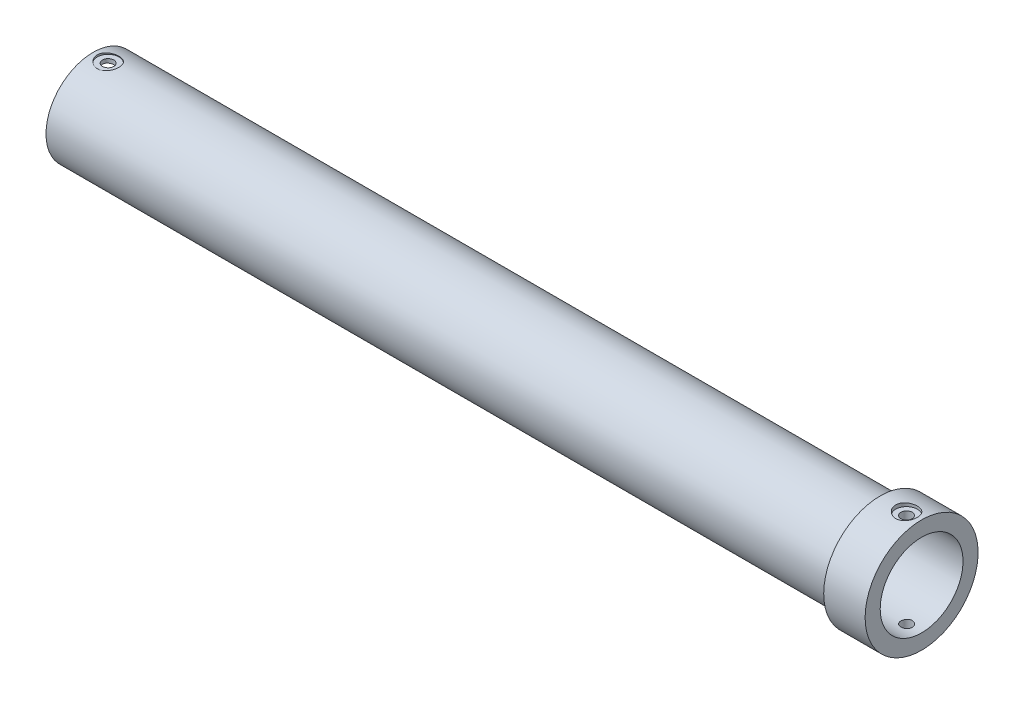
ISO-10303-21;
HEADER;
FILE_DESCRIPTION(('STEP AP214'),'2;1');
FILE_NAME('part.step','',(''),(''),'','','');
FILE_SCHEMA(('AUTOMOTIVE_DESIGN { 1 0 10303 214 1 1 1 1 }'));
ENDSEC;
DATA;
#1=APPLICATION_CONTEXT('core data for automotive mechanical design processes');
#2=APPLICATION_PROTOCOL_DEFINITION('international standard','automotive_design',2000,#1);
#3=PRODUCT_CONTEXT('',#1,'mechanical');
#4=PRODUCT('Part','Part','',(#3));
#5=PRODUCT_RELATED_PRODUCT_CATEGORY('part','',(#4));
#6=PRODUCT_DEFINITION_FORMATION('','',#4);
#7=PRODUCT_DEFINITION_CONTEXT('part definition',#1,'design');
#8=PRODUCT_DEFINITION('design','',#6,#7);
#9=PRODUCT_DEFINITION_SHAPE('','',#8);
#10=(LENGTH_UNIT() NAMED_UNIT(*) SI_UNIT(.MILLI.,.METRE.));
#11=(NAMED_UNIT(*) PLANE_ANGLE_UNIT() SI_UNIT($,.RADIAN.));
#12=(NAMED_UNIT(*) SI_UNIT($,.STERADIAN.) SOLID_ANGLE_UNIT());
#13=UNCERTAINTY_MEASURE_WITH_UNIT(LENGTH_MEASURE(1.E-05),#10,'distance_accuracy_value','');
#14=(GEOMETRIC_REPRESENTATION_CONTEXT(3) GLOBAL_UNCERTAINTY_ASSIGNED_CONTEXT((#13)) GLOBAL_UNIT_ASSIGNED_CONTEXT((#10,
#11,#12)) REPRESENTATION_CONTEXT('',''));
#15=CARTESIAN_POINT('',(0.,0.,0.));
#16=DIRECTION('',(0.,0.,1.));
#17=DIRECTION('',(1.,0.,0.));
#18=AXIS2_PLACEMENT_3D('',#15,#16,#17);
#19=CARTESIAN_POINT('',(4.,-5.,0.));
#20=DIRECTION('',(0.,-1.,0.));
#21=DIRECTION('',(0.,0.,-1.));
#22=AXIS2_PLACEMENT_3D('',#19,#20,#21);
#23=CYLINDRICAL_SURFACE('',#22,1.5);
#24=CARTESIAN_POINT('',(4.,-10.8972473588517,-1.50000000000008));
#25=CARTESIAN_POINT('',(4.08383432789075,-10.8972486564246,-1.49999647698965));
#26=CARTESIAN_POINT('',(4.16771944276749,-10.8982252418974,-1.49294806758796));
#27=CARTESIAN_POINT('',(4.33315047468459,-10.9020240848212,-1.46494465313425));
#28=CARTESIAN_POINT('',(4.41469393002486,-10.9048482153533,-1.44397553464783));
#29=CARTESIAN_POINT('',(4.57302278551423,-10.9120164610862,-1.38876442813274));
#30=CARTESIAN_POINT('',(4.64981155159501,-10.9163594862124,-1.35453195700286));
#31=CARTESIAN_POINT('',(4.7965419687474,-10.9260748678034,-1.27378718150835));
#32=CARTESIAN_POINT('',(4.86648468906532,-10.9314470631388,-1.22727679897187));
#33=CARTESIAN_POINT('',(4.99801459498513,-10.9426553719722,-1.12296630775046));
#34=CARTESIAN_POINT('',(5.05954976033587,-10.9484940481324,-1.06510087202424));
#35=CARTESIAN_POINT('',(5.17206780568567,-10.9599544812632,-0.93986372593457));
#36=CARTESIAN_POINT('',(5.22305013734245,-10.9655762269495,-0.87249152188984));
#37=CARTESIAN_POINT('',(5.31320440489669,-10.9759958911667,-0.729823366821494));
#38=CARTESIAN_POINT('',(5.35232887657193,-10.9807904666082,-0.65449715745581));
#39=CARTESIAN_POINT('',(5.41735256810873,-10.9889873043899,-0.498266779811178));
#40=CARTESIAN_POINT('',(5.44325236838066,-10.9923896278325,-0.417362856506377));
#41=CARTESIAN_POINT('',(5.48093503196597,-10.9974005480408,-0.252807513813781));
#42=CARTESIAN_POINT('',(5.49280469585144,-10.9990201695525,-0.169176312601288));
#43=CARTESIAN_POINT('',(5.50235938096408,-11.0003209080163,-0.00109450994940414));
#44=CARTESIAN_POINT('',(5.50004506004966,-11.0000021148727,0.0833560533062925));
#45=CARTESIAN_POINT('',(5.48136657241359,-10.9974708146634,0.250088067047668));
#46=CARTESIAN_POINT('',(5.46509577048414,-10.9952708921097,0.332380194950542));
#47=CARTESIAN_POINT('',(5.41911239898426,-10.9892385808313,0.493054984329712));
#48=CARTESIAN_POINT('',(5.38939953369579,-10.9854061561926,0.571437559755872));
#49=CARTESIAN_POINT('',(5.31727779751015,-10.9765177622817,0.722354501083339));
#50=CARTESIAN_POINT('',(5.27482899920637,-10.9714579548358,0.79486955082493));
#51=CARTESIAN_POINT('',(5.17846945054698,-10.9606799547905,0.931782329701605));
#52=CARTESIAN_POINT('',(5.12455807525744,-10.9549617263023,0.996179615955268));
#53=CARTESIAN_POINT('',(5.00628199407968,-10.9434509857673,1.11557819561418));
#54=CARTESIAN_POINT('',(4.94183585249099,-10.9376582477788,1.17049882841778));
#55=CARTESIAN_POINT('',(4.80459804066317,-10.9266970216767,1.26875693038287));
#56=CARTESIAN_POINT('',(4.73180633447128,-10.9215285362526,1.31209434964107));
#57=CARTESIAN_POINT('',(4.57986654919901,-10.9124011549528,1.38596314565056));
#58=CARTESIAN_POINT('',(4.50071490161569,-10.9084429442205,1.41648727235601));
#59=CARTESIAN_POINT('',(4.33834296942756,-10.9021970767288,1.46378734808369));
#60=CARTESIAN_POINT('',(4.25512292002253,-10.8999093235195,1.48056409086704));
#61=CARTESIAN_POINT('',(4.08769115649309,-10.8972813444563,1.49978470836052));
#62=CARTESIAN_POINT('',(4.00349274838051,-10.8969256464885,1.50234245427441));
#63=CARTESIAN_POINT('',(3.83586858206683,-10.8981610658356,1.49335366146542));
#64=CARTESIAN_POINT('',(3.75244280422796,-10.8997521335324,1.48180748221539));
#65=CARTESIAN_POINT('',(3.58907826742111,-10.9046876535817,1.44503477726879));
#66=CARTESIAN_POINT('',(3.50912670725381,-10.9080249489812,1.4198640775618));
#67=CARTESIAN_POINT('',(3.35457827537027,-10.9160710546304,1.35661456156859));
#68=CARTESIAN_POINT('',(3.27998162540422,-10.9207799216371,1.31853521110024));
#69=CARTESIAN_POINT('',(3.13774739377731,-10.9310754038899,1.2302721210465));
#70=CARTESIAN_POINT('',(3.07015628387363,-10.9366673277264,1.18001412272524));
#71=CARTESIAN_POINT('',(2.94432749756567,-10.9480824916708,1.06892459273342));
#72=CARTESIAN_POINT('',(2.88609025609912,-10.9539057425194,1.00809256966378));
#73=CARTESIAN_POINT('',(2.78021847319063,-10.9651753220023,0.877082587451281));
#74=CARTESIAN_POINT('',(2.73265903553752,-10.9706188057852,0.806843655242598));
#75=CARTESIAN_POINT('',(2.6500141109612,-10.9804722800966,0.659307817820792));
#76=CARTESIAN_POINT('',(2.61492833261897,-10.9848822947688,0.582011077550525));
#77=CARTESIAN_POINT('',(2.55834897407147,-10.9921593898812,0.422796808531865));
#78=CARTESIAN_POINT('',(2.53681300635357,-10.9950312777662,0.340894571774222));
#79=CARTESIAN_POINT('',(2.50780699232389,-10.9989285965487,0.174594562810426));
#80=CARTESIAN_POINT('',(2.50033618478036,-10.9999541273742,0.0901969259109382));
#81=CARTESIAN_POINT('',(2.49968866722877,-11.0000424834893,-0.0779669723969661));
#82=CARTESIAN_POINT('',(2.50639654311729,-10.9991211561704,-0.161732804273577));
#83=CARTESIAN_POINT('',(2.5336702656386,-10.9954510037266,-0.326934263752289));
#84=CARTESIAN_POINT('',(2.55423608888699,-10.9927021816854,-0.408369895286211));
#85=CARTESIAN_POINT('',(2.60860359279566,-10.9856844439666,-0.566576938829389));
#86=CARTESIAN_POINT('',(2.6423986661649,-10.9814162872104,-0.643350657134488));
#87=CARTESIAN_POINT('',(2.72225330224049,-10.9718308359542,-0.790155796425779));
#88=CARTESIAN_POINT('',(2.76831312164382,-10.9665135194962,-0.860187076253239));
#89=CARTESIAN_POINT('',(2.87181278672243,-10.9553706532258,-0.992107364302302));
#90=CARTESIAN_POINT('',(2.92933826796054,-10.9495414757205,-1.05392888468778));
#91=CARTESIAN_POINT('',(3.05395687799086,-10.9380600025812,-1.16708474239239));
#92=CARTESIAN_POINT('',(3.12105225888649,-10.932407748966,-1.2184166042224));
#93=CARTESIAN_POINT('',(3.26326484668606,-10.9218923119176,-1.309343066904));
#94=CARTESIAN_POINT('',(3.33841754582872,-10.9170328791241,-1.34888257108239));
#95=CARTESIAN_POINT('',(3.49432379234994,-10.908697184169,-1.41472146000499));
#96=CARTESIAN_POINT('',(3.57507126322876,-10.905219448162,-1.44103496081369));
#97=CARTESIAN_POINT('',(3.7135113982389,-10.9008677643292,-1.47351601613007));
#98=CARTESIAN_POINT('',(3.77033821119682,-10.8995170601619,-1.48343283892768));
#99=CARTESIAN_POINT('',(3.88476868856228,-10.8977064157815,-1.49667600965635));
#100=CARTESIAN_POINT('',(3.9423723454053,-10.897246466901,-1.50000242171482));
#101=CARTESIAN_POINT('',(4.,-10.8972473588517,-1.50000000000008));
#102=B_SPLINE_CURVE_WITH_KNOTS('',3,(#24,#25,#26,#27,#28,#29,#30,#31,#32,#33,#34,#35,#36,#37,
#38,#39,#40,#41,#42,#43,#44,#45,#46,#47,#48,#49,#50,#51,#52,#53,#54,#55,#56,#57,#58,#59,#60,#61,
#62,#63,#64,#65,#66,#67,#68,#69,#70,#71,#72,#73,#74,#75,#76,#77,#78,#79,#80,#81,#82,#83,#84,#85,
#86,#87,#88,#89,#90,#91,#92,#93,#94,#95,#96,#97,#98,#99,#100,#101),.UNSPECIFIED.,.T.,.F.,(4,2,2,
2,2,2,2,2,2,2,2,2,2,2,2,2,2,2,2,2,2,2,2,2,2,2,2,2,2,2,2,2,2,2,2,2,2,2,4),(0.,0.251292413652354,
0.502839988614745,0.754207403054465,1.00553549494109,1.25835430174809,1.51118624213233,
1.76501723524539,2.01883708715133,2.27107826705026,2.52330774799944,2.77386293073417,
3.02442362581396,3.27577819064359,3.52714646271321,3.78055871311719,4.03397205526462,
4.28752859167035,4.54107048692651,4.79257896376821,5.04408103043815,5.29456029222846,
5.5450499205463,5.79710712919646,6.04917605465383,6.30296596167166,6.55674993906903,
6.80973601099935,7.0627083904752,7.31362951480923,7.56455021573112,7.81534575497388,
8.06614654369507,8.31889590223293,8.57170483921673,8.82567709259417,9.07937770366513,
9.2521176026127,9.42485582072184),.UNSPECIFIED.);
#103=CARTESIAN_POINT('',(4.,-10.8972473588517,-1.50000000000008));
#104=VERTEX_POINT('',#103);
#105=EDGE_CURVE('E86',#104,#104,#102,.T.);
#106=ORIENTED_EDGE('',*,*,#105,.F.);
#107=EDGE_LOOP('',(#106));
#108=FACE_BOUND('',#107,.T.);
#109=CARTESIAN_POINT('',(4.,-12.,0.));
#110=DIRECTION('',(0.,-1.,0.));
#111=DIRECTION('',(0.,0.,-1.));
#112=AXIS2_PLACEMENT_3D('',#109,#110,#111);
#113=CIRCLE('',#112,1.5);
#114=CARTESIAN_POINT('',(4.,-12.,-1.50000000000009));
#115=VERTEX_POINT('',#114);
#116=EDGE_CURVE('E65',#115,#115,#113,.F.);
#117=ORIENTED_EDGE('',*,*,#116,.F.);
#118=EDGE_LOOP('',(#117));
#119=FACE_BOUND('',#118,.T.);
#120=ADVANCED_FACE('F38',(#108,#119),#23,.F.);
#121=CARTESIAN_POINT('',(4.,5.,0.));
#122=DIRECTION('',(0.,1.,0.));
#123=DIRECTION('',(0.,0.,1.));
#124=AXIS2_PLACEMENT_3D('',#121,#122,#123);
#125=CYLINDRICAL_SURFACE('',#124,1.5);
#126=CARTESIAN_POINT('',(4.,10.8972473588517,1.5));
#127=CARTESIAN_POINT('',(4.08383432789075,10.8972486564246,1.49999647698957));
#128=CARTESIAN_POINT('',(4.16771944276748,10.8982252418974,1.49294806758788));
#129=CARTESIAN_POINT('',(4.33315047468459,10.9020240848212,1.46494465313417));
#130=CARTESIAN_POINT('',(4.41469393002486,10.9048482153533,1.44397553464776));
#131=CARTESIAN_POINT('',(4.57302278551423,10.9120164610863,1.38876442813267));
#132=CARTESIAN_POINT('',(4.64981155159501,10.9163594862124,1.35453195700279));
#133=CARTESIAN_POINT('',(4.7965419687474,10.9260748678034,1.27378718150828));
#134=CARTESIAN_POINT('',(4.86648468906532,10.9314470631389,1.2272767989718));
#135=CARTESIAN_POINT('',(4.99801459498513,10.9426553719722,1.12296630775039));
#136=CARTESIAN_POINT('',(5.05954976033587,10.9484940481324,1.06510087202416));
#137=CARTESIAN_POINT('',(5.17206780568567,10.9599544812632,0.939863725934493));
#138=CARTESIAN_POINT('',(5.22305013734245,10.9655762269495,0.872491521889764));
#139=CARTESIAN_POINT('',(5.31320440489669,10.9759958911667,0.729823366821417));
#140=CARTESIAN_POINT('',(5.35232887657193,10.9807904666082,0.654497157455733));
#141=CARTESIAN_POINT('',(5.41735256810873,10.9889873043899,0.498266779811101));
#142=CARTESIAN_POINT('',(5.44325236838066,10.9923896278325,0.4173628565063));
#143=CARTESIAN_POINT('',(5.48093503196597,10.9974005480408,0.252807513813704));
#144=CARTESIAN_POINT('',(5.49280469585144,10.9990201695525,0.169176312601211));
#145=CARTESIAN_POINT('',(5.50235938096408,11.0003209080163,0.00109450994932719));
#146=CARTESIAN_POINT('',(5.50004506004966,11.0000021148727,-0.0833560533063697));
#147=CARTESIAN_POINT('',(5.48136657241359,10.9974708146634,-0.250088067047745));
#148=CARTESIAN_POINT('',(5.46509577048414,10.9952708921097,-0.332380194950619));
#149=CARTESIAN_POINT('',(5.41911239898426,10.9892385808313,-0.49305498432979));
#150=CARTESIAN_POINT('',(5.38939953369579,10.9854061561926,-0.57143755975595));
#151=CARTESIAN_POINT('',(5.31727779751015,10.9765177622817,-0.722354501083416));
#152=CARTESIAN_POINT('',(5.27482899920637,10.9714579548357,-0.794869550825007));
#153=CARTESIAN_POINT('',(5.17846945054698,10.9606799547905,-0.931782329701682));
#154=CARTESIAN_POINT('',(5.12455807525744,10.9549617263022,-0.996179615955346));
#155=CARTESIAN_POINT('',(5.00628199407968,10.9434509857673,-1.11557819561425));
#156=CARTESIAN_POINT('',(4.94183585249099,10.9376582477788,-1.17049882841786));
#157=CARTESIAN_POINT('',(4.80459804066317,10.9266970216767,-1.26875693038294));
#158=CARTESIAN_POINT('',(4.73180633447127,10.9215285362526,-1.31209434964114));
#159=CARTESIAN_POINT('',(4.57986654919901,10.9124011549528,-1.38596314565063));
#160=CARTESIAN_POINT('',(4.50071490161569,10.9084429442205,-1.41648727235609));
#161=CARTESIAN_POINT('',(4.33834296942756,10.9021970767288,-1.46378734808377));
#162=CARTESIAN_POINT('',(4.25512292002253,10.8999093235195,-1.48056409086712));
#163=CARTESIAN_POINT('',(4.08769115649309,10.8972813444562,-1.49978470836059));
#164=CARTESIAN_POINT('',(4.00349274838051,10.8969256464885,-1.50234245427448));
#165=CARTESIAN_POINT('',(3.83586858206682,10.8981610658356,-1.4933536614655));
#166=CARTESIAN_POINT('',(3.75244280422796,10.8997521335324,-1.48180748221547));
#167=CARTESIAN_POINT('',(3.5890782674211,10.9046876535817,-1.44503477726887));
#168=CARTESIAN_POINT('',(3.50912670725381,10.9080249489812,-1.41986407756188));
#169=CARTESIAN_POINT('',(3.35457827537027,10.9160710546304,-1.35661456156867));
#170=CARTESIAN_POINT('',(3.27998162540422,10.9207799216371,-1.31853521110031));
#171=CARTESIAN_POINT('',(3.1377473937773,10.9310754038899,-1.23027212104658));
#172=CARTESIAN_POINT('',(3.07015628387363,10.9366673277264,-1.18001412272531));
#173=CARTESIAN_POINT('',(2.94432749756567,10.9480824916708,-1.06892459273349));
#174=CARTESIAN_POINT('',(2.88609025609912,10.9539057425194,-1.00809256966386));
#175=CARTESIAN_POINT('',(2.78021847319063,10.9651753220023,-0.877082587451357));
#176=CARTESIAN_POINT('',(2.73265903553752,10.9706188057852,-0.806843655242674));
#177=CARTESIAN_POINT('',(2.6500141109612,10.9804722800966,-0.659307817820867));
#178=CARTESIAN_POINT('',(2.61492833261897,10.9848822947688,-0.5820110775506));
#179=CARTESIAN_POINT('',(2.55834897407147,10.9921593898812,-0.422796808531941));
#180=CARTESIAN_POINT('',(2.53681300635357,10.9950312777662,-0.340894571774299));
#181=CARTESIAN_POINT('',(2.50780699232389,10.9989285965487,-0.174594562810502));
#182=CARTESIAN_POINT('',(2.50033618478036,10.9999541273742,-0.0901969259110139));
#183=CARTESIAN_POINT('',(2.49968866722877,11.0000424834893,0.0779669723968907));
#184=CARTESIAN_POINT('',(2.50639654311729,10.9991211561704,0.161732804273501));
#185=CARTESIAN_POINT('',(2.5336702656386,10.9954510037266,0.326934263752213));
#186=CARTESIAN_POINT('',(2.55423608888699,10.9927021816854,0.408369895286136));
#187=CARTESIAN_POINT('',(2.60860359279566,10.9856844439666,0.566576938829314));
#188=CARTESIAN_POINT('',(2.6423986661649,10.9814162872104,0.643350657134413));
#189=CARTESIAN_POINT('',(2.72225330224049,10.9718308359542,0.790155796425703));
#190=CARTESIAN_POINT('',(2.76831312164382,10.9665135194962,0.860187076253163));
#191=CARTESIAN_POINT('',(2.87181278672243,10.9553706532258,0.992107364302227));
#192=CARTESIAN_POINT('',(2.92933826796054,10.9495414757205,1.0539288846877));
#193=CARTESIAN_POINT('',(3.05395687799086,10.9380600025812,1.16708474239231));
#194=CARTESIAN_POINT('',(3.12105225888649,10.932407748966,1.21841660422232));
#195=CARTESIAN_POINT('',(3.26326484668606,10.9218923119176,1.30934306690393));
#196=CARTESIAN_POINT('',(3.33841754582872,10.9170328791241,1.34888257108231));
#197=CARTESIAN_POINT('',(3.49432379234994,10.908697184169,1.41472146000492));
#198=CARTESIAN_POINT('',(3.57507126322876,10.905219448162,1.44103496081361));
#199=CARTESIAN_POINT('',(3.7135113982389,10.9008677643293,1.47351601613));
#200=CARTESIAN_POINT('',(3.77033821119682,10.899517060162,1.4834328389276));
#201=CARTESIAN_POINT('',(3.88476868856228,10.8977064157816,1.49667600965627));
#202=CARTESIAN_POINT('',(3.9423723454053,10.897246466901,1.50000242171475));
#203=CARTESIAN_POINT('',(4.,10.8972473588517,1.5));
#204=B_SPLINE_CURVE_WITH_KNOTS('',3,(#126,#127,#128,#129,#130,#131,#132,#133,#134,#135,#136,
#137,#138,#139,#140,#141,#142,#143,#144,#145,#146,#147,#148,#149,#150,#151,#152,#153,#154,#155,
#156,#157,#158,#159,#160,#161,#162,#163,#164,#165,#166,#167,#168,#169,#170,#171,#172,#173,#174,
#175,#176,#177,#178,#179,#180,#181,#182,#183,#184,#185,#186,#187,#188,#189,#190,#191,#192,#193,
#194,#195,#196,#197,#198,#199,#200,#201,#202,#203),.UNSPECIFIED.,.T.,.F.,(4,2,2,2,2,2,2,2,2,2,2,
2,2,2,2,2,2,2,2,2,2,2,2,2,2,2,2,2,2,2,2,2,2,2,2,2,2,2,4),(0.,0.251292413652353,
0.502839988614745,0.754207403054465,1.00553549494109,1.25835430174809,1.51118624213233,
1.76501723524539,2.01883708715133,2.27107826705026,2.52330774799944,2.77386293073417,
3.02442362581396,3.27577819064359,3.52714646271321,3.7805587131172,4.03397205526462,
4.28752859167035,4.54107048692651,4.79257896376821,5.04408103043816,5.29456029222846,
5.54504992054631,5.79710712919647,6.04917605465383,6.30296596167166,6.55674993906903,
6.80973601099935,7.0627083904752,7.31362951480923,7.56455021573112,7.81534575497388,
8.06614654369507,8.31889590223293,8.57170483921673,8.82567709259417,9.07937770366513,
9.2521176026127,9.42485582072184),.UNSPECIFIED.);
#205=CARTESIAN_POINT('',(4.,10.8972473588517,1.5));
#206=VERTEX_POINT('',#205);
#207=EDGE_CURVE('E92',#206,#206,#204,.T.);
#208=ORIENTED_EDGE('',*,*,#207,.F.);
#209=EDGE_LOOP('',(#208));
#210=FACE_BOUND('',#209,.T.);
#211=CARTESIAN_POINT('',(4.,12.,0.));
#212=DIRECTION('',(0.,1.,0.));
#213=DIRECTION('',(0.,0.,1.));
#214=AXIS2_PLACEMENT_3D('',#211,#212,#213);
#215=CIRCLE('',#214,1.5);
#216=CARTESIAN_POINT('',(4.,12.,1.5));
#217=VERTEX_POINT('',#216);
#218=EDGE_CURVE('E64',#217,#217,#215,.F.);
#219=ORIENTED_EDGE('',*,*,#218,.F.);
#220=EDGE_LOOP('',(#219));
#221=FACE_BOUND('',#220,.T.);
#222=ADVANCED_FACE('F81',(#210,#221),#125,.F.);
#223=CARTESIAN_POINT('',(216.,-3.,0.));
#224=DIRECTION('',(0.,-1.,0.));
#225=DIRECTION('',(0.,0.,-1.));
#226=AXIS2_PLACEMENT_3D('',#223,#224,#225);
#227=CYLINDRICAL_SURFACE('',#226,1.5);
#228=CARTESIAN_POINT('',(216.,-10.8972473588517,-1.50000000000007));
#229=CARTESIAN_POINT('',(216.083834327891,-10.8972486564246,-1.49999647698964));
#230=CARTESIAN_POINT('',(216.167719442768,-10.8982252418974,-1.49294806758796));
#231=CARTESIAN_POINT('',(216.333150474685,-10.9020240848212,-1.46494465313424));
#232=CARTESIAN_POINT('',(216.414693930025,-10.9048482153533,-1.44397553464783));
#233=CARTESIAN_POINT('',(216.573022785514,-10.9120164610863,-1.38876442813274));
#234=CARTESIAN_POINT('',(216.649811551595,-10.9163594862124,-1.35453195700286));
#235=CARTESIAN_POINT('',(216.796541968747,-10.9260748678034,-1.27378718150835));
#236=CARTESIAN_POINT('',(216.866484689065,-10.9314470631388,-1.22727679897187));
#237=CARTESIAN_POINT('',(216.998014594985,-10.9426553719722,-1.12296630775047));
#238=CARTESIAN_POINT('',(217.059549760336,-10.9484940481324,-1.06510087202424));
#239=CARTESIAN_POINT('',(217.172067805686,-10.9599544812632,-0.939863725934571));
#240=CARTESIAN_POINT('',(217.223050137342,-10.9655762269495,-0.872491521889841));
#241=CARTESIAN_POINT('',(217.313204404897,-10.9759958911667,-0.729823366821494));
#242=CARTESIAN_POINT('',(217.352328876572,-10.9807904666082,-0.654497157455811));
#243=CARTESIAN_POINT('',(217.417352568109,-10.9889873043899,-0.498266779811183));
#244=CARTESIAN_POINT('',(217.443252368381,-10.9923896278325,-0.417362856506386));
#245=CARTESIAN_POINT('',(217.480935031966,-10.9974005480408,-0.252807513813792));
#246=CARTESIAN_POINT('',(217.492804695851,-10.9990201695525,-0.169176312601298));
#247=CARTESIAN_POINT('',(217.502359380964,-11.0003209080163,-0.00109450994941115));
#248=CARTESIAN_POINT('',(217.50004506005,-11.0000021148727,0.0833560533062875));
#249=CARTESIAN_POINT('',(217.481366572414,-10.9974708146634,0.250088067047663));
#250=CARTESIAN_POINT('',(217.465095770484,-10.9952708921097,0.332380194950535));
#251=CARTESIAN_POINT('',(217.419112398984,-10.9892385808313,0.493054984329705));
#252=CARTESIAN_POINT('',(217.389399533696,-10.9854061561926,0.571437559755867));
#253=CARTESIAN_POINT('',(217.31727779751,-10.9765177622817,0.722354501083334));
#254=CARTESIAN_POINT('',(217.274828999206,-10.9714579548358,0.794869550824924));
#255=CARTESIAN_POINT('',(217.178469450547,-10.9606799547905,0.931782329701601));
#256=CARTESIAN_POINT('',(217.124558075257,-10.9549617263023,0.996179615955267));
#257=CARTESIAN_POINT('',(217.00628199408,-10.9434509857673,1.11557819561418));
#258=CARTESIAN_POINT('',(216.941835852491,-10.9376582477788,1.17049882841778));
#259=CARTESIAN_POINT('',(216.804598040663,-10.9266970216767,1.26875693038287));
#260=CARTESIAN_POINT('',(216.731806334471,-10.9215285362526,1.31209434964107));
#261=CARTESIAN_POINT('',(216.579866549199,-10.9124011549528,1.38596314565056));
#262=CARTESIAN_POINT('',(216.500714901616,-10.9084429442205,1.41648727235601));
#263=CARTESIAN_POINT('',(216.338342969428,-10.9021970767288,1.46378734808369));
#264=CARTESIAN_POINT('',(216.255122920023,-10.8999093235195,1.48056409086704));
#265=CARTESIAN_POINT('',(216.087691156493,-10.8972813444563,1.49978470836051));
#266=CARTESIAN_POINT('',(216.003492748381,-10.8969256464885,1.5023424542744));
#267=CARTESIAN_POINT('',(215.835868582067,-10.8981610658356,1.49335366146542));
#268=CARTESIAN_POINT('',(215.752442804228,-10.8997521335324,1.48180748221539));
#269=CARTESIAN_POINT('',(215.589078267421,-10.9046876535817,1.44503477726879));
#270=CARTESIAN_POINT('',(215.509126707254,-10.9080249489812,1.4198640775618));
#271=CARTESIAN_POINT('',(215.35457827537,-10.9160710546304,1.35661456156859));
#272=CARTESIAN_POINT('',(215.279981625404,-10.9207799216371,1.31853521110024));
#273=CARTESIAN_POINT('',(215.137747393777,-10.9310754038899,1.2302721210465));
#274=CARTESIAN_POINT('',(215.070156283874,-10.9366673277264,1.18001412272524));
#275=CARTESIAN_POINT('',(214.944327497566,-10.9480824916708,1.06892459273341));
#276=CARTESIAN_POINT('',(214.886090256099,-10.9539057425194,1.00809256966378));
#277=CARTESIAN_POINT('',(214.780218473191,-10.9651753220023,0.877082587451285));
#278=CARTESIAN_POINT('',(214.732659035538,-10.9706188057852,0.806843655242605));
#279=CARTESIAN_POINT('',(214.650014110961,-10.9804722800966,0.659307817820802));
#280=CARTESIAN_POINT('',(214.614928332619,-10.9848822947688,0.582011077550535));
#281=CARTESIAN_POINT('',(214.558348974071,-10.9921593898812,0.422796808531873));
#282=CARTESIAN_POINT('',(214.536813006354,-10.9950312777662,0.340894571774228));
#283=CARTESIAN_POINT('',(214.507806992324,-10.9989285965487,0.174594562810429));
#284=CARTESIAN_POINT('',(214.50033618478,-10.9999541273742,0.0901969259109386));
#285=CARTESIAN_POINT('',(214.499688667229,-11.0000424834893,-0.0779669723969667));
#286=CARTESIAN_POINT('',(214.506396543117,-10.9991211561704,-0.161732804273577));
#287=CARTESIAN_POINT('',(214.533670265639,-10.9954510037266,-0.326934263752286));
#288=CARTESIAN_POINT('',(214.554236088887,-10.9927021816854,-0.408369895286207));
#289=CARTESIAN_POINT('',(214.608603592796,-10.9856844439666,-0.566576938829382));
#290=CARTESIAN_POINT('',(214.642398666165,-10.9814162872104,-0.64335065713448));
#291=CARTESIAN_POINT('',(214.722253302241,-10.9718308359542,-0.790155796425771));
#292=CARTESIAN_POINT('',(214.768313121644,-10.9665135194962,-0.860187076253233));
#293=CARTESIAN_POINT('',(214.871812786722,-10.9553706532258,-0.9921073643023));
#294=CARTESIAN_POINT('',(214.929338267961,-10.9495414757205,-1.05392888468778));
#295=CARTESIAN_POINT('',(215.053956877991,-10.9380600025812,-1.16708474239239));
#296=CARTESIAN_POINT('',(215.121052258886,-10.932407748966,-1.2184166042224));
#297=CARTESIAN_POINT('',(215.263264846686,-10.9218923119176,-1.309343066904));
#298=CARTESIAN_POINT('',(215.338417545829,-10.9170328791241,-1.34888257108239));
#299=CARTESIAN_POINT('',(215.49432379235,-10.908697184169,-1.41472146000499));
#300=CARTESIAN_POINT('',(215.575071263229,-10.905219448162,-1.44103496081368));
#301=CARTESIAN_POINT('',(215.713511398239,-10.9008677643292,-1.47351601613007));
#302=CARTESIAN_POINT('',(215.770338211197,-10.8995170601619,-1.48343283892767));
#303=CARTESIAN_POINT('',(215.884768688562,-10.8977064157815,-1.49667600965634));
#304=CARTESIAN_POINT('',(215.942372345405,-10.897246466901,-1.50000242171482));
#305=CARTESIAN_POINT('',(216.,-10.8972473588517,-1.50000000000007));
#306=B_SPLINE_CURVE_WITH_KNOTS('',3,(#228,#229,#230,#231,#232,#233,#234,#235,#236,#237,#238,
#239,#240,#241,#242,#243,#244,#245,#246,#247,#248,#249,#250,#251,#252,#253,#254,#255,#256,#257,
#258,#259,#260,#261,#262,#263,#264,#265,#266,#267,#268,#269,#270,#271,#272,#273,#274,#275,#276,
#277,#278,#279,#280,#281,#282,#283,#284,#285,#286,#287,#288,#289,#290,#291,#292,#293,#294,#295,
#296,#297,#298,#299,#300,#301,#302,#303,#304,#305),.UNSPECIFIED.,.T.,.F.,(4,2,2,2,2,2,2,2,2,2,2,
2,2,2,2,2,2,2,2,2,2,2,2,2,2,2,2,2,2,2,2,2,2,2,2,2,2,2,4),(0.,0.251292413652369,
0.502839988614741,0.754207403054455,1.00553549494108,1.25835430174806,1.51118624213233,
1.76501723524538,2.01883708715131,2.27107826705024,2.52330774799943,2.77386293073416,
3.02442362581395,3.27577819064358,3.5271464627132,3.78055871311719,4.03397205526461,
4.28752859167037,4.54107048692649,4.79257896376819,5.04408103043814,5.29456029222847,
5.54504992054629,5.79710712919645,6.0491760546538,6.30296596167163,6.55674993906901,
6.80973601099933,7.06270839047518,7.31362951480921,7.5645502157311,7.81534575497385,
8.06614654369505,8.31889590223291,8.5717048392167,8.82567709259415,9.0793777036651,
9.25211760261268,9.42485582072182),.UNSPECIFIED.);
#307=CARTESIAN_POINT('',(216.,-10.8972473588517,-1.50000000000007));
#308=VERTEX_POINT('',#307);
#309=EDGE_CURVE('E240',#308,#308,#306,.T.);
#310=ORIENTED_EDGE('',*,*,#309,.F.);
#311=EDGE_LOOP('',(#310));
#312=FACE_BOUND('',#311,.T.);
#313=CARTESIAN_POINT('',(216.,-14.,0.));
#314=DIRECTION('',(0.,-1.,0.));
#315=DIRECTION('',(0.,0.,-1.));
#316=AXIS2_PLACEMENT_3D('',#313,#314,#315);
#317=CIRCLE('',#316,1.5);
#318=CARTESIAN_POINT('',(216.,-14.,-1.5000000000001));
#319=VERTEX_POINT('',#318);
#320=EDGE_CURVE('E230',#319,#319,#317,.F.);
#321=ORIENTED_EDGE('',*,*,#320,.F.);
#322=EDGE_LOOP('',(#321));
#323=FACE_BOUND('',#322,.T.);
#324=ADVANCED_FACE('F148',(#312,#323),#227,.F.);
#325=CARTESIAN_POINT('',(216.,3.,0.));
#326=DIRECTION('',(0.,1.,0.));
#327=DIRECTION('',(0.,0.,1.));
#328=AXIS2_PLACEMENT_3D('',#325,#326,#327);
#329=CYLINDRICAL_SURFACE('',#328,1.5);
#330=CARTESIAN_POINT('',(216.,10.8972473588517,1.5));
#331=CARTESIAN_POINT('',(216.083834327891,10.8972486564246,1.49999647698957));
#332=CARTESIAN_POINT('',(216.167719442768,10.8982252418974,1.49294806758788));
#333=CARTESIAN_POINT('',(216.333150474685,10.9020240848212,1.46494465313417));
#334=CARTESIAN_POINT('',(216.414693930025,10.9048482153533,1.44397553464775));
#335=CARTESIAN_POINT('',(216.573022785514,10.9120164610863,1.38876442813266));
#336=CARTESIAN_POINT('',(216.649811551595,10.9163594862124,1.35453195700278));
#337=CARTESIAN_POINT('',(216.796541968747,10.9260748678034,1.27378718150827));
#338=CARTESIAN_POINT('',(216.866484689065,10.9314470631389,1.2272767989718));
#339=CARTESIAN_POINT('',(216.998014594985,10.9426553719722,1.12296630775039));
#340=CARTESIAN_POINT('',(217.059549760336,10.9484940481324,1.06510087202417));
#341=CARTESIAN_POINT('',(217.172067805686,10.9599544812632,0.939863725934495));
#342=CARTESIAN_POINT('',(217.223050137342,10.9655762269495,0.872491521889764));
#343=CARTESIAN_POINT('',(217.313204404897,10.9759958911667,0.729823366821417));
#344=CARTESIAN_POINT('',(217.352328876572,10.9807904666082,0.654497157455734));
#345=CARTESIAN_POINT('',(217.417352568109,10.9889873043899,0.498266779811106));
#346=CARTESIAN_POINT('',(217.443252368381,10.9923896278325,0.417362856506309));
#347=CARTESIAN_POINT('',(217.480935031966,10.9974005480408,0.252807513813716));
#348=CARTESIAN_POINT('',(217.492804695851,10.9990201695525,0.169176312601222));
#349=CARTESIAN_POINT('',(217.502359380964,11.0003209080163,0.00109450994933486));
#350=CARTESIAN_POINT('',(217.50004506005,11.0000021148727,-0.0833560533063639));
#351=CARTESIAN_POINT('',(217.481366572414,10.9974708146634,-0.250088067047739));
#352=CARTESIAN_POINT('',(217.465095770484,10.9952708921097,-0.332380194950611));
#353=CARTESIAN_POINT('',(217.419112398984,10.9892385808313,-0.493054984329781));
#354=CARTESIAN_POINT('',(217.389399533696,10.9854061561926,-0.571437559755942));
#355=CARTESIAN_POINT('',(217.31727779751,10.9765177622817,-0.722354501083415));
#356=CARTESIAN_POINT('',(217.274828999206,10.9714579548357,-0.794869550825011));
#357=CARTESIAN_POINT('',(217.178469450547,10.9606799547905,-0.931782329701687));
#358=CARTESIAN_POINT('',(217.124558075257,10.9549617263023,-0.996179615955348));
#359=CARTESIAN_POINT('',(217.00628199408,10.9434509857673,-1.11557819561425));
#360=CARTESIAN_POINT('',(216.941835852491,10.9376582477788,-1.17049882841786));
#361=CARTESIAN_POINT('',(216.804598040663,10.9266970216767,-1.26875693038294));
#362=CARTESIAN_POINT('',(216.731806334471,10.9215285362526,-1.31209434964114));
#363=CARTESIAN_POINT('',(216.579866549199,10.9124011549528,-1.38596314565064));
#364=CARTESIAN_POINT('',(216.500714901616,10.9084429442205,-1.41648727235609));
#365=CARTESIAN_POINT('',(216.338342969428,10.9021970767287,-1.46378734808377));
#366=CARTESIAN_POINT('',(216.255122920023,10.8999093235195,-1.48056409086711));
#367=CARTESIAN_POINT('',(216.087691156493,10.8972813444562,-1.49978470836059));
#368=CARTESIAN_POINT('',(216.003492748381,10.8969256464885,-1.50234245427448));
#369=CARTESIAN_POINT('',(215.835868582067,10.8981610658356,-1.49335366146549));
#370=CARTESIAN_POINT('',(215.752442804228,10.8997521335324,-1.48180748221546));
#371=CARTESIAN_POINT('',(215.589078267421,10.9046876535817,-1.44503477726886));
#372=CARTESIAN_POINT('',(215.509126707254,10.9080249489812,-1.41986407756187));
#373=CARTESIAN_POINT('',(215.35457827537,10.9160710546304,-1.35661456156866));
#374=CARTESIAN_POINT('',(215.279981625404,10.9207799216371,-1.31853521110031));
#375=CARTESIAN_POINT('',(215.137747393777,10.9310754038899,-1.23027212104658));
#376=CARTESIAN_POINT('',(215.070156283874,10.9366673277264,-1.18001412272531));
#377=CARTESIAN_POINT('',(214.944327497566,10.9480824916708,-1.06892459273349));
#378=CARTESIAN_POINT('',(214.886090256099,10.9539057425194,-1.00809256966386));
#379=CARTESIAN_POINT('',(214.780218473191,10.9651753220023,-0.877082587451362));
#380=CARTESIAN_POINT('',(214.732659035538,10.9706188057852,-0.806843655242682));
#381=CARTESIAN_POINT('',(214.650014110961,10.9804722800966,-0.659307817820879));
#382=CARTESIAN_POINT('',(214.614928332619,10.9848822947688,-0.582011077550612));
#383=CARTESIAN_POINT('',(214.558348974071,10.9921593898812,-0.42279680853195));
#384=CARTESIAN_POINT('',(214.536813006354,10.9950312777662,-0.340894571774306));
#385=CARTESIAN_POINT('',(214.507806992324,10.9989285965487,-0.174594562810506));
#386=CARTESIAN_POINT('',(214.50033618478,10.9999541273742,-0.0901969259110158));
#387=CARTESIAN_POINT('',(214.499688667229,11.0000424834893,0.0779669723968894));
#388=CARTESIAN_POINT('',(214.506396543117,10.9991211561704,0.161732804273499));
#389=CARTESIAN_POINT('',(214.533670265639,10.9954510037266,0.326934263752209));
#390=CARTESIAN_POINT('',(214.554236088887,10.9927021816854,0.40836989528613));
#391=CARTESIAN_POINT('',(214.608603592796,10.9856844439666,0.566576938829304));
#392=CARTESIAN_POINT('',(214.642398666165,10.9814162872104,0.643350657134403));
#393=CARTESIAN_POINT('',(214.722253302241,10.9718308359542,0.790155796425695));
#394=CARTESIAN_POINT('',(214.768313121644,10.9665135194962,0.860187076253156));
#395=CARTESIAN_POINT('',(214.871812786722,10.9553706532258,0.992107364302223));
#396=CARTESIAN_POINT('',(214.929338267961,10.9495414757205,1.0539288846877));
#397=CARTESIAN_POINT('',(215.053956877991,10.9380600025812,1.16708474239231));
#398=CARTESIAN_POINT('',(215.121052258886,10.932407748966,1.21841660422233));
#399=CARTESIAN_POINT('',(215.263264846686,10.9218923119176,1.30934306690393));
#400=CARTESIAN_POINT('',(215.338417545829,10.9170328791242,1.34888257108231));
#401=CARTESIAN_POINT('',(215.49432379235,10.908697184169,1.41472146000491));
#402=CARTESIAN_POINT('',(215.575071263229,10.9052194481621,1.44103496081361));
#403=CARTESIAN_POINT('',(215.713511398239,10.9008677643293,1.47351601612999));
#404=CARTESIAN_POINT('',(215.770338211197,10.899517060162,1.4834328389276));
#405=CARTESIAN_POINT('',(215.884768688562,10.8977064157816,1.49667600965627));
#406=CARTESIAN_POINT('',(215.942372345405,10.897246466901,1.50000242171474));
#407=CARTESIAN_POINT('',(216.,10.8972473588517,1.5));
#408=B_SPLINE_CURVE_WITH_KNOTS('',3,(#330,#331,#332,#333,#334,#335,#336,#337,#338,#339,#340,
#341,#342,#343,#344,#345,#346,#347,#348,#349,#350,#351,#352,#353,#354,#355,#356,#357,#358,#359,
#360,#361,#362,#363,#364,#365,#366,#367,#368,#369,#370,#371,#372,#373,#374,#375,#376,#377,#378,
#379,#380,#381,#382,#383,#384,#385,#386,#387,#388,#389,#390,#391,#392,#393,#394,#395,#396,#397,
#398,#399,#400,#401,#402,#403,#404,#405,#406,#407),.UNSPECIFIED.,.T.,.F.,(4,2,2,2,2,2,2,2,2,2,2,
2,2,2,2,2,2,2,2,2,2,2,2,2,2,2,2,2,2,2,2,2,2,2,2,2,2,2,4),(0.,0.251292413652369,
0.502839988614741,0.754207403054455,1.00553549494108,1.25835430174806,1.51118624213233,
1.76501723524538,2.01883708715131,2.27107826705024,2.52330774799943,2.77386293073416,
3.02442362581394,3.27577819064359,3.5271464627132,3.78055871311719,4.03397205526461,
4.28752859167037,4.54107048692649,4.79257896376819,5.04408103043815,5.29456029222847,
5.54504992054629,5.79710712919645,6.0491760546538,6.30296596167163,6.55674993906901,
6.80973601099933,7.06270839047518,7.31362951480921,7.5645502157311,7.81534575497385,
8.06614654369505,8.31889590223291,8.5717048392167,8.82567709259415,9.0793777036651,
9.25211760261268,9.42485582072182),.UNSPECIFIED.);
#409=CARTESIAN_POINT('',(216.,10.8972473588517,1.5));
#410=VERTEX_POINT('',#409);
#411=EDGE_CURVE('E129',#410,#410,#408,.T.);
#412=ORIENTED_EDGE('',*,*,#411,.F.);
#413=EDGE_LOOP('',(#412));
#414=FACE_BOUND('',#413,.T.);
#415=CARTESIAN_POINT('',(216.,14.,0.));
#416=DIRECTION('',(0.,1.,0.));
#417=DIRECTION('',(0.,0.,1.));
#418=AXIS2_PLACEMENT_3D('',#415,#416,#417);
#419=CIRCLE('',#418,1.5);
#420=CARTESIAN_POINT('',(216.,14.,1.5));
#421=VERTEX_POINT('',#420);
#422=EDGE_CURVE('E137',#421,#421,#419,.F.);
#423=ORIENTED_EDGE('',*,*,#422,.F.);
#424=EDGE_LOOP('',(#423));
#425=FACE_BOUND('',#424,.T.);
#426=ADVANCED_FACE('F143',(#414,#425),#329,.F.);
#427=CARTESIAN_POINT('',(153.,5.,0.));
#428=DIRECTION('',(1.,0.,0.));
#429=DIRECTION('',(0.,0.,-1.));
#430=AXIS2_PLACEMENT_3D('',#427,#428,#429);
#431=PLANE('',#430);
#432=CARTESIAN_POINT('',(153.,-3.49999999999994,-6.0621778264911));
#433=DIRECTION('',(1.,0.,0.));
#434=DIRECTION('',(0.,0.,-1.));
#435=AXIS2_PLACEMENT_3D('',#432,#433,#434);
#436=CIRCLE('',#435,1.25);
#437=CARTESIAN_POINT('',(153.,-3.49999999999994,-7.3121778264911));
#438=VERTEX_POINT('',#437);
#439=EDGE_CURVE('E283',#438,#438,#436,.T.);
#440=ORIENTED_EDGE('',*,*,#439,.T.);
#441=EDGE_LOOP('',(#440));
#442=FACE_BOUND('',#441,.T.);
#443=CARTESIAN_POINT('',(153.,-3.50000000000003,6.06217782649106));
#444=DIRECTION('',(1.,0.,0.));
#445=DIRECTION('',(0.,0.,-1.));
#446=AXIS2_PLACEMENT_3D('',#443,#444,#445);
#447=CIRCLE('',#446,1.25);
#448=CARTESIAN_POINT('',(153.,-3.50000000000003,4.81217782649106));
#449=VERTEX_POINT('',#448);
#450=EDGE_CURVE('E279',#449,#449,#447,.T.);
#451=ORIENTED_EDGE('',*,*,#450,.T.);
#452=EDGE_LOOP('',(#451));
#453=FACE_BOUND('',#452,.T.);
#454=CARTESIAN_POINT('',(153.,7.,0.));
#455=DIRECTION('',(1.,0.,0.));
#456=DIRECTION('',(0.,0.,-1.));
#457=AXIS2_PLACEMENT_3D('',#454,#455,#456);
#458=CIRCLE('',#457,1.25);
#459=CARTESIAN_POINT('',(153.,7.,-1.25));
#460=VERTEX_POINT('',#459);
#461=EDGE_CURVE('E272',#460,#460,#458,.T.);
#462=ORIENTED_EDGE('',*,*,#461,.T.);
#463=EDGE_LOOP('',(#462));
#464=FACE_BOUND('',#463,.T.);
#465=CARTESIAN_POINT('',(153.,0.,0.));
#466=DIRECTION('',(-1.,0.,0.));
#467=DIRECTION('',(0.,0.,1.));
#468=AXIS2_PLACEMENT_3D('',#465,#466,#467);
#469=CIRCLE('',#468,5.);
#470=CARTESIAN_POINT('',(153.,0.,5.));
#471=VERTEX_POINT('',#470);
#472=EDGE_CURVE('E136',#471,#471,#469,.T.);
#473=ORIENTED_EDGE('',*,*,#472,.F.);
#474=EDGE_LOOP('',(#473));
#475=FACE_BOUND('',#474,.T.);
#476=CARTESIAN_POINT('',(153.,0.,0.));
#477=DIRECTION('',(-1.,0.,0.));
#478=DIRECTION('',(0.,0.,1.));
#479=AXIS2_PLACEMENT_3D('',#476,#477,#478);
#480=CIRCLE('',#479,11.);
#481=CARTESIAN_POINT('',(153.,0.,11.));
#482=VERTEX_POINT('',#481);
#483=EDGE_CURVE('E120',#482,#482,#480,.T.);
#484=ORIENTED_EDGE('',*,*,#483,.T.);
#485=EDGE_LOOP('',(#484));
#486=FACE_BOUND('',#485,.T.);
#487=ADVANCED_FACE('F40',(#442,#453,#464,#475,#486),#431,.F.);
#488=CARTESIAN_POINT('',(0.,0.,0.));
#489=DIRECTION('',(-1.,0.,0.));
#490=DIRECTION('',(0.,0.,1.));
#491=AXIS2_PLACEMENT_3D('',#488,#489,#490);
#492=CYLINDRICAL_SURFACE('',#491,11.);
#493=ORIENTED_EDGE('',*,*,#105,.T.);
#494=EDGE_LOOP('',(#493));
#495=FACE_BOUND('',#494,.T.);
#496=ORIENTED_EDGE('',*,*,#207,.T.);
#497=EDGE_LOOP('',(#496));
#498=FACE_BOUND('',#497,.T.);
#499=ORIENTED_EDGE('',*,*,#483,.F.);
#500=EDGE_LOOP('',(#499));
#501=FACE_BOUND('',#500,.T.);
#502=CARTESIAN_POINT('',(0.,0.,0.));
#503=DIRECTION('',(-1.,0.,0.));
#504=DIRECTION('',(0.,0.,1.));
#505=AXIS2_PLACEMENT_3D('',#502,#503,#504);
#506=CIRCLE('',#505,11.);
#507=CARTESIAN_POINT('',(0.,0.,11.));
#508=VERTEX_POINT('',#507);
#509=EDGE_CURVE('E113',#508,#508,#506,.T.);
#510=ORIENTED_EDGE('',*,*,#509,.T.);
#511=EDGE_LOOP('',(#510));
#512=FACE_BOUND('',#511,.T.);
#513=ADVANCED_FACE('F98',(#495,#498,#501,#512),#492,.F.);
#514=CARTESIAN_POINT('',(0.,12.5,0.));
#515=DIRECTION('',(1.,0.,0.));
#516=DIRECTION('',(0.,0.,-1.));
#517=AXIS2_PLACEMENT_3D('',#514,#515,#516);
#518=PLANE('',#517);
#519=ORIENTED_EDGE('',*,*,#509,.F.);
#520=EDGE_LOOP('',(#519));
#521=FACE_BOUND('',#520,.T.);
#522=CARTESIAN_POINT('',(0.,0.,0.));
#523=DIRECTION('',(-1.,0.,0.));
#524=DIRECTION('',(0.,0.,1.));
#525=AXIS2_PLACEMENT_3D('',#522,#523,#524);
#526=CIRCLE('',#525,12.5);
#527=CARTESIAN_POINT('',(0.,0.,12.5));
#528=VERTEX_POINT('',#527);
#529=EDGE_CURVE('E116',#528,#528,#526,.T.);
#530=ORIENTED_EDGE('',*,*,#529,.T.);
#531=EDGE_LOOP('',(#530));
#532=FACE_BOUND('',#531,.T.);
#533=ADVANCED_FACE('F101',(#521,#532),#518,.F.);
#534=CARTESIAN_POINT('',(0.,0.,0.));
#535=DIRECTION('',(-1.,0.,0.));
#536=DIRECTION('',(0.,0.,1.));
#537=AXIS2_PLACEMENT_3D('',#534,#535,#536);
#538=CYLINDRICAL_SURFACE('',#537,12.5);
#539=CARTESIAN_POINT('',(4.,-12.1648828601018,-2.87500000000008));
#540=CARTESIAN_POINT('',(3.84081872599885,-12.1648860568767,-2.87499482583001));
#541=CARTESIAN_POINT('',(3.68157705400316,-12.1680413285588,-2.86173482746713));
#542=CARTESIAN_POINT('',(3.36763756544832,-12.180295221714,-2.80911230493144));
#543=CARTESIAN_POINT('',(3.21294288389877,-12.1893978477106,-2.76973219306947));
#544=CARTESIAN_POINT('',(2.91268381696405,-12.2124622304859,-2.6661876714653));
#545=CARTESIAN_POINT('',(2.76710903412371,-12.226418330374,-2.60205210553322));
#546=CARTESIAN_POINT('',(2.48877781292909,-12.257610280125,-2.45090178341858));
#547=CARTESIAN_POINT('',(2.35602139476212,-12.274846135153,-2.36388699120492));
#548=CARTESIAN_POINT('',(2.1046175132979,-12.3110150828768,-2.16771648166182));
#549=CARTESIAN_POINT('',(1.98624420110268,-12.3299718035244,-2.05821371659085));
#550=CARTESIAN_POINT('',(1.76937265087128,-12.367240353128,-1.82092429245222));
#551=CARTESIAN_POINT('',(1.6708760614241,-12.3855521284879,-1.69313611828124));
#552=CARTESIAN_POINT('',(1.49545651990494,-12.4197263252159,-1.42105120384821));
#553=CARTESIAN_POINT('',(1.41879922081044,-12.4355576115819,-1.27657894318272));
#554=CARTESIAN_POINT('',(1.2909559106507,-12.4627192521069,-0.976376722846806));
#555=CARTESIAN_POINT('',(1.2397667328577,-12.4740501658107,-0.820648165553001));
#556=CARTESIAN_POINT('',(1.16518051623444,-12.490767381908,-0.505207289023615));
#557=CARTESIAN_POINT('',(1.14131891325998,-12.4962529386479,-0.345610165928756));
#558=CARTESIAN_POINT('',(1.12061070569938,-12.5010059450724,-0.0245901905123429));
#559=CARTESIAN_POINT('',(1.12376069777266,-12.5002741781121,0.136832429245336));
#560=CARTESIAN_POINT('',(1.15664436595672,-12.4927501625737,0.453711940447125));
#561=CARTESIAN_POINT('',(1.18587706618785,-12.4860721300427,0.609223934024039));
#562=CARTESIAN_POINT('',(1.26929562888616,-12.4675370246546,0.913073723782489));
#563=CARTESIAN_POINT('',(1.32348269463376,-12.4556797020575,1.06141117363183));
#564=CARTESIAN_POINT('',(1.45570170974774,-12.4279377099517,1.34806721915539));
#565=CARTESIAN_POINT('',(1.533919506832,-12.4120218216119,1.48629694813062));
#566=CARTESIAN_POINT('',(1.71184031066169,-12.3779015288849,1.74784904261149));
#567=CARTESIAN_POINT('',(1.81154653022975,-12.3596967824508,1.87116917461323));
#568=CARTESIAN_POINT('',(2.03232723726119,-12.322500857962,2.10238436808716));
#569=CARTESIAN_POINT('',(2.15384004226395,-12.3035012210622,2.20985992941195));
#570=CARTESIAN_POINT('',(2.41336249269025,-12.2672455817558,2.40299185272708));
#571=CARTESIAN_POINT('',(2.55137268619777,-12.2499896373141,2.48864748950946));
#572=CARTESIAN_POINT('',(2.84070009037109,-12.2191497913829,2.63592233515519));
#573=CARTESIAN_POINT('',(2.99206295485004,-12.2055791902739,2.69745482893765));
#574=CARTESIAN_POINT('',(3.30336849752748,-12.183825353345,2.79407920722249));
#575=CARTESIAN_POINT('',(3.4633096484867,-12.1756411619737,2.82917578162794));
#576=CARTESIAN_POINT('',(3.78337858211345,-12.1657837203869,2.8712658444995));
#577=CARTESIAN_POINT('',(3.94342132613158,-12.1639682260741,2.87887341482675));
#578=CARTESIAN_POINT('',(4.26248845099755,-12.1666688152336,2.86743854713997));
#579=CARTESIAN_POINT('',(4.42151290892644,-12.1711844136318,2.84839815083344));
#580=CARTESIAN_POINT('',(4.73184256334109,-12.1859033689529,2.78474266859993));
#581=CARTESIAN_POINT('',(4.88322247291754,-12.1960299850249,2.74047241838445));
#582=CARTESIAN_POINT('',(5.17641527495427,-12.2207594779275,2.62799033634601));
#583=CARTESIAN_POINT('',(5.31822717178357,-12.2353628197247,2.55977601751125));
#584=CARTESIAN_POINT('',(5.59089671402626,-12.2677083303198,2.40001281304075));
#585=CARTESIAN_POINT('',(5.7215290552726,-12.2854993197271,2.30808949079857));
#586=CARTESIAN_POINT('',(5.96573963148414,-12.3220899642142,2.10400180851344));
#587=CARTESIAN_POINT('',(6.07931550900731,-12.3408897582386,1.99183465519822));
#588=CARTESIAN_POINT('',(6.28860851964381,-12.3778532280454,1.74765065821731));
#589=CARTESIAN_POINT('',(6.38390482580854,-12.3959955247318,1.61526931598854));
#590=CARTESIAN_POINT('',(6.55090811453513,-12.4291908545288,1.3360221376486));
#591=CARTESIAN_POINT('',(6.62261625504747,-12.4442440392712,1.18915701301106));
#592=CARTESIAN_POINT('',(6.73983959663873,-12.4694757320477,0.886070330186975));
#593=CARTESIAN_POINT('',(6.78552993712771,-12.4796867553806,0.729919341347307));
#594=CARTESIAN_POINT('',(6.84996131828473,-12.4942248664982,0.411894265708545));
#595=CARTESIAN_POINT('',(6.86870671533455,-12.4985529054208,0.250021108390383));
#596=CARTESIAN_POINT('',(6.87850301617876,-12.5008054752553,-0.0708732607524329));
#597=CARTESIAN_POINT('',(6.87017959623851,-12.4988746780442,-0.229874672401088));
#598=CARTESIAN_POINT('',(6.82748565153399,-12.4891402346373,-0.544147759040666));
#599=CARTESIAN_POINT('',(6.79311569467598,-12.4813367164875,-0.699419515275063));
#600=CARTESIAN_POINT('',(6.69961717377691,-12.4607484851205,-1.00128209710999));
#601=CARTESIAN_POINT('',(6.64058590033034,-12.4479833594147,-1.14790447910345));
#602=CARTESIAN_POINT('',(6.49953220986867,-12.4188281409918,-1.42924235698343));
#603=CARTESIAN_POINT('',(6.41750731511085,-12.4024376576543,-1.56395656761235));
#604=CARTESIAN_POINT('',(6.23080021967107,-12.3673879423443,-1.82067748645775));
#605=CARTESIAN_POINT('',(6.12568322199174,-12.3486886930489,-1.94236253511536));
#606=CARTESIAN_POINT('',(5.89664165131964,-12.3113315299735,-2.16657925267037));
#607=CARTESIAN_POINT('',(5.77271248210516,-12.2926736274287,-2.26910622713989));
#608=CARTESIAN_POINT('',(5.50730729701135,-12.2571945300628,-2.45360233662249));
#609=CARTESIAN_POINT('',(5.36559410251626,-12.2404054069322,-2.53523685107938));
#610=CARTESIAN_POINT('',(5.07009793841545,-12.2109768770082,-2.67340062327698));
#611=CARTESIAN_POINT('',(4.91632481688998,-12.1983341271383,-2.72995011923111));
#612=CARTESIAN_POINT('',(4.63544354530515,-12.1808443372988,-2.80681444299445));
#613=CARTESIAN_POINT('',(4.50980188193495,-12.1749002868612,-2.83233275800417));
#614=CARTESIAN_POINT('',(4.25611975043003,-12.1669183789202,-2.86642711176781));
#615=CARTESIAN_POINT('',(4.12807942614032,-12.1648802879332,-2.87500416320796));
#616=CARTESIAN_POINT('',(4.,-12.1648828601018,-2.87500000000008));
#617=B_SPLINE_CURVE_WITH_KNOTS('',3,(#539,#540,#541,#542,#543,#544,#545,#546,#547,#548,#549,
#550,#551,#552,#553,#554,#555,#556,#557,#558,#559,#560,#561,#562,#563,#564,#565,#566,#567,#568,
#569,#570,#571,#572,#573,#574,#575,#576,#577,#578,#579,#580,#581,#582,#583,#584,#585,#586,#587,
#588,#589,#590,#591,#592,#593,#594,#595,#596,#597,#598,#599,#600,#601,#602,#603,#604,#605,#606,
#607,#608,#609,#610,#611,#612,#613,#614,#615,#616),.UNSPECIFIED.,.T.,.F.,(4,2,2,2,2,2,2,2,2,2,2,
2,2,2,2,2,2,2,2,2,2,2,2,2,2,2,2,2,2,2,2,2,2,2,2,2,2,2,4),(0.,0.477074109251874,
0.954469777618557,1.43131087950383,1.90815273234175,2.39299657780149,2.87788062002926,
3.36843289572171,3.85892416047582,4.3409472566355,4.82290962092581,5.29580948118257,
5.76873214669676,6.24540849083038,6.72215615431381,7.20985742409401,7.69757490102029,
8.18702983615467,8.67639791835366,9.15476388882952,9.63309320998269,10.1050364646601,
10.5770287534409,11.0569879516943,11.5370134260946,12.0270282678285,12.5170190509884,
13.0036712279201,13.4902447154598,13.9656520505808,14.4410490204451,14.9145879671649,
15.3881779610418,15.8715943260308,16.3551289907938,16.8459817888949,17.3364378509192,
17.7203211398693,18.1041814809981),.UNSPECIFIED.);
#618=CARTESIAN_POINT('',(4.,-12.1648828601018,-2.87500000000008));
#619=VERTEX_POINT('',#618);
#620=EDGE_CURVE('E10',#619,#619,#617,.T.);
#621=ORIENTED_EDGE('',*,*,#620,.T.);
#622=EDGE_LOOP('',(#621));
#623=FACE_BOUND('',#622,.T.);
#624=CARTESIAN_POINT('',(4.,12.1648828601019,2.875));
#625=CARTESIAN_POINT('',(3.84081872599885,12.1648860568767,2.87499482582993));
#626=CARTESIAN_POINT('',(3.68157705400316,12.1680413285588,2.86173482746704));
#627=CARTESIAN_POINT('',(3.36763756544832,12.1802952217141,2.80911230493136));
#628=CARTESIAN_POINT('',(3.21294288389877,12.1893978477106,2.76973219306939));
#629=CARTESIAN_POINT('',(2.91268381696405,12.212462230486,2.66618767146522));
#630=CARTESIAN_POINT('',(2.76710903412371,12.2264183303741,2.60205210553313));
#631=CARTESIAN_POINT('',(2.48877781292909,12.257610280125,2.45090178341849));
#632=CARTESIAN_POINT('',(2.35602139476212,12.274846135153,2.36388699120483));
#633=CARTESIAN_POINT('',(2.1046175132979,12.3110150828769,2.16771648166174));
#634=CARTESIAN_POINT('',(1.98624420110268,12.3299718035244,2.05821371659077));
#635=CARTESIAN_POINT('',(1.76937265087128,12.367240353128,1.82092429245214));
#636=CARTESIAN_POINT('',(1.6708760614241,12.3855521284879,1.69313611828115));
#637=CARTESIAN_POINT('',(1.49545651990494,12.4197263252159,1.42105120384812));
#638=CARTESIAN_POINT('',(1.41879922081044,12.4355576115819,1.27657894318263));
#639=CARTESIAN_POINT('',(1.2909559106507,12.4627192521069,0.976376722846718));
#640=CARTESIAN_POINT('',(1.2397667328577,12.4740501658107,0.820648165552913));
#641=CARTESIAN_POINT('',(1.16518051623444,12.490767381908,0.505207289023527));
#642=CARTESIAN_POINT('',(1.14131891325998,12.4962529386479,0.345610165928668));
#643=CARTESIAN_POINT('',(1.12061070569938,12.5010059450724,0.0245901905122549));
#644=CARTESIAN_POINT('',(1.12376069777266,12.5002741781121,-0.136832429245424));
#645=CARTESIAN_POINT('',(1.15664436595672,12.4927501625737,-0.453711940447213));
#646=CARTESIAN_POINT('',(1.18587706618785,12.4860721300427,-0.609223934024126));
#647=CARTESIAN_POINT('',(1.26929562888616,12.4675370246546,-0.913073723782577));
#648=CARTESIAN_POINT('',(1.32348269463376,12.4556797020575,-1.06141117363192));
#649=CARTESIAN_POINT('',(1.45570170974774,12.4279377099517,-1.34806721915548));
#650=CARTESIAN_POINT('',(1.533919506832,12.4120218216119,-1.4862969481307));
#651=CARTESIAN_POINT('',(1.71184031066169,12.3779015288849,-1.74784904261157));
#652=CARTESIAN_POINT('',(1.81154653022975,12.3596967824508,-1.87116917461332));
#653=CARTESIAN_POINT('',(2.03232723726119,12.322500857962,-2.10238436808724));
#654=CARTESIAN_POINT('',(2.15384004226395,12.3035012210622,-2.20985992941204));
#655=CARTESIAN_POINT('',(2.41336249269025,12.2672455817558,-2.40299185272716));
#656=CARTESIAN_POINT('',(2.55137268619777,12.2499896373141,-2.48864748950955));
#657=CARTESIAN_POINT('',(2.84070009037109,12.2191497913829,-2.63592233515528));
#658=CARTESIAN_POINT('',(2.99206295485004,12.2055791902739,-2.69745482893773));
#659=CARTESIAN_POINT('',(3.30336849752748,12.1838253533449,-2.79407920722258));
#660=CARTESIAN_POINT('',(3.4633096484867,12.1756411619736,-2.82917578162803));
#661=CARTESIAN_POINT('',(3.78337858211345,12.1657837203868,-2.87126584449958));
#662=CARTESIAN_POINT('',(3.94342132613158,12.1639682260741,-2.87887341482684));
#663=CARTESIAN_POINT('',(4.26248845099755,12.1666688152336,-2.86743854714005));
#664=CARTESIAN_POINT('',(4.42151290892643,12.1711844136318,-2.84839815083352));
#665=CARTESIAN_POINT('',(4.73184256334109,12.1859033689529,-2.78474266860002));
#666=CARTESIAN_POINT('',(4.88322247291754,12.1960299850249,-2.74047241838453));
#667=CARTESIAN_POINT('',(5.17641527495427,12.2207594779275,-2.6279903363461));
#668=CARTESIAN_POINT('',(5.31822717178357,12.2353628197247,-2.55977601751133));
#669=CARTESIAN_POINT('',(5.59089671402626,12.2677083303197,-2.40001281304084));
#670=CARTESIAN_POINT('',(5.7215290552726,12.285499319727,-2.30808949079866));
#671=CARTESIAN_POINT('',(5.96573963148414,12.3220899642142,-2.10400180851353));
#672=CARTESIAN_POINT('',(6.07931550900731,12.3408897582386,-1.99183465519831));
#673=CARTESIAN_POINT('',(6.28860851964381,12.3778532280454,-1.7476506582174));
#674=CARTESIAN_POINT('',(6.38390482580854,12.3959955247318,-1.61526931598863));
#675=CARTESIAN_POINT('',(6.55090811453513,12.4291908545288,-1.33602213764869));
#676=CARTESIAN_POINT('',(6.62261625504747,12.4442440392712,-1.18915701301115));
#677=CARTESIAN_POINT('',(6.73983959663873,12.4694757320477,-0.886070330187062));
#678=CARTESIAN_POINT('',(6.78552993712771,12.4796867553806,-0.729919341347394));
#679=CARTESIAN_POINT('',(6.84996131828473,12.4942248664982,-0.411894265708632));
#680=CARTESIAN_POINT('',(6.86870671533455,12.4985529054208,-0.250021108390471));
#681=CARTESIAN_POINT('',(6.87850301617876,12.5008054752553,0.0708732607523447));
#682=CARTESIAN_POINT('',(6.87017959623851,12.4988746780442,0.229874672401));
#683=CARTESIAN_POINT('',(6.82748565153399,12.4891402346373,0.544147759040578));
#684=CARTESIAN_POINT('',(6.79311569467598,12.4813367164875,0.699419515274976));
#685=CARTESIAN_POINT('',(6.69961717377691,12.4607484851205,1.0012820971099));
#686=CARTESIAN_POINT('',(6.64058590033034,12.4479833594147,1.14790447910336));
#687=CARTESIAN_POINT('',(6.49953220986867,12.4188281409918,1.42924235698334));
#688=CARTESIAN_POINT('',(6.41750731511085,12.4024376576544,1.56395656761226));
#689=CARTESIAN_POINT('',(6.23080021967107,12.3673879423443,1.82067748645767));
#690=CARTESIAN_POINT('',(6.12568322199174,12.3486886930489,1.94236253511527));
#691=CARTESIAN_POINT('',(5.89664165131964,12.3113315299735,2.16657925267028));
#692=CARTESIAN_POINT('',(5.77271248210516,12.2926736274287,2.2691062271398));
#693=CARTESIAN_POINT('',(5.50730729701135,12.2571945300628,2.45360233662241));
#694=CARTESIAN_POINT('',(5.36559410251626,12.2404054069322,2.5352368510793));
#695=CARTESIAN_POINT('',(5.07009793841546,12.2109768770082,2.67340062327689));
#696=CARTESIAN_POINT('',(4.91632481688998,12.1983341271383,2.72995011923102));
#697=CARTESIAN_POINT('',(4.63544354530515,12.1808443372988,2.80681444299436));
#698=CARTESIAN_POINT('',(4.50980188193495,12.1749002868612,2.83233275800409));
#699=CARTESIAN_POINT('',(4.25611975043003,12.1669183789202,2.86642711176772));
#700=CARTESIAN_POINT('',(4.12807942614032,12.1648802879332,2.87500416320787));
#701=CARTESIAN_POINT('',(4.,12.1648828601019,2.875));
#702=B_SPLINE_CURVE_WITH_KNOTS('',3,(#624,#625,#626,#627,#628,#629,#630,#631,#632,#633,#634,
#635,#636,#637,#638,#639,#640,#641,#642,#643,#644,#645,#646,#647,#648,#649,#650,#651,#652,#653,
#654,#655,#656,#657,#658,#659,#660,#661,#662,#663,#664,#665,#666,#667,#668,#669,#670,#671,#672,
#673,#674,#675,#676,#677,#678,#679,#680,#681,#682,#683,#684,#685,#686,#687,#688,#689,#690,#691,
#692,#693,#694,#695,#696,#697,#698,#699,#700,#701),.UNSPECIFIED.,.T.,.F.,(4,2,2,2,2,2,2,2,2,2,2,
2,2,2,2,2,2,2,2,2,2,2,2,2,2,2,2,2,2,2,2,2,2,2,2,2,2,2,4),(0.,0.477074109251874,
0.954469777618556,1.43131087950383,1.90815273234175,2.39299657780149,2.87788062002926,
3.36843289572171,3.85892416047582,4.3409472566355,4.82290962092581,5.29580948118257,
5.76873214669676,6.24540849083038,6.72215615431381,7.209857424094,7.69757490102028,
8.18702983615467,8.67639791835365,9.15476388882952,9.63309320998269,10.1050364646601,
10.5770287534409,11.0569879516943,11.5370134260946,12.0270282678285,12.5170190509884,
13.0036712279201,13.4902447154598,13.9656520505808,14.4410490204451,14.9145879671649,
15.3881779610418,15.8715943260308,16.3551289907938,16.8459817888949,17.3364378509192,
17.7203211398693,18.104181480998),.UNSPECIFIED.);
#703=CARTESIAN_POINT('',(4.,12.1648828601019,2.875));
#704=VERTEX_POINT('',#703);
#705=EDGE_CURVE('E49',#704,#704,#702,.T.);
#706=ORIENTED_EDGE('',*,*,#705,.T.);
#707=EDGE_LOOP('',(#706));
#708=FACE_BOUND('',#707,.T.);
#709=ORIENTED_EDGE('',*,*,#529,.F.);
#710=EDGE_LOOP('',(#709));
#711=FACE_BOUND('',#710,.T.);
#712=CARTESIAN_POINT('',(208.133974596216,0.,0.));
#713=DIRECTION('',(-1.,0.,0.));
#714=DIRECTION('',(0.,0.,1.));
#715=AXIS2_PLACEMENT_3D('',#712,#713,#714);
#716=CIRCLE('',#715,12.5);
#717=CARTESIAN_POINT('',(208.133974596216,0.,12.5));
#718=VERTEX_POINT('',#717);
#719=EDGE_CURVE('E118',#718,#718,#716,.T.);
#720=ORIENTED_EDGE('',*,*,#719,.T.);
#721=EDGE_LOOP('',(#720));
#722=FACE_BOUND('',#721,.T.);
#723=ADVANCED_FACE('F66',(#623,#708,#711,#722),#538,.T.);
#724=CARTESIAN_POINT('',(209.,0.,0.));
#725=DIRECTION('',(1.,0.,0.));
#726=DIRECTION('',(0.,0.,-1.));
#727=AXIS2_PLACEMENT_3D('',#724,#725,#726);
#728=CONICAL_SURFACE('',#727,13.,0.523598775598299);
#729=ORIENTED_EDGE('',*,*,#719,.F.);
#730=EDGE_LOOP('',(#729));
#731=FACE_BOUND('',#730,.T.);
#732=CARTESIAN_POINT('',(209.,0.,0.));
#733=DIRECTION('',(-1.,0.,0.));
#734=DIRECTION('',(0.,0.,1.));
#735=AXIS2_PLACEMENT_3D('',#732,#733,#734);
#736=CIRCLE('',#735,13.);
#737=CARTESIAN_POINT('',(209.,0.,13.));
#738=VERTEX_POINT('',#737);
#739=EDGE_CURVE('E123',#738,#738,#736,.T.);
#740=ORIENTED_EDGE('',*,*,#739,.T.);
#741=EDGE_LOOP('',(#740));
#742=FACE_BOUND('',#741,.T.);
#743=ADVANCED_FACE('F109',(#731,#742),#728,.T.);
#744=CARTESIAN_POINT('',(209.,15.,0.));
#745=DIRECTION('',(1.,0.,0.));
#746=DIRECTION('',(0.,0.,-1.));
#747=AXIS2_PLACEMENT_3D('',#744,#745,#746);
#748=PLANE('',#747);
#749=ORIENTED_EDGE('',*,*,#739,.F.);
#750=EDGE_LOOP('',(#749));
#751=FACE_BOUND('',#750,.T.);
#752=CARTESIAN_POINT('',(209.,0.,0.));
#753=DIRECTION('',(-1.,0.,0.));
#754=DIRECTION('',(0.,0.,1.));
#755=AXIS2_PLACEMENT_3D('',#752,#753,#754);
#756=CIRCLE('',#755,15.);
#757=CARTESIAN_POINT('',(209.,0.,15.));
#758=VERTEX_POINT('',#757);
#759=EDGE_CURVE('E195',#758,#758,#756,.T.);
#760=ORIENTED_EDGE('',*,*,#759,.T.);
#761=EDGE_LOOP('',(#760));
#762=FACE_BOUND('',#761,.T.);
#763=ADVANCED_FACE('F201',(#751,#762),#748,.F.);
#764=CARTESIAN_POINT('',(0.,0.,0.));
#765=DIRECTION('',(-1.,0.,0.));
#766=DIRECTION('',(0.,0.,1.));
#767=AXIS2_PLACEMENT_3D('',#764,#765,#766);
#768=CYLINDRICAL_SURFACE('',#767,15.);
#769=CARTESIAN_POINT('',(216.,-14.7219012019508,-2.87500000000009));
#770=CARTESIAN_POINT('',(215.840109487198,-14.7219043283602,-2.87499393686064));
#771=CARTESIAN_POINT('',(215.680141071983,-14.7245342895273,-2.86161648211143));
#772=CARTESIAN_POINT('',(215.364719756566,-14.7347561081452,-2.80849896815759));
#773=CARTESIAN_POINT('',(215.209270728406,-14.7423520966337,-2.76873696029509));
#774=CARTESIAN_POINT('',(214.907497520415,-14.7616147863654,-2.66412031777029));
#775=CARTESIAN_POINT('',(214.761164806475,-14.7732776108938,-2.59928957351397));
#776=CARTESIAN_POINT('',(214.48146043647,-14.7993552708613,-2.44643975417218));
#777=CARTESIAN_POINT('',(214.348087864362,-14.8137699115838,-2.3584223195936));
#778=CARTESIAN_POINT('',(214.096347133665,-14.8439363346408,-2.16047809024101));
#779=CARTESIAN_POINT('',(213.978171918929,-14.8597017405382,-2.05030795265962));
#780=CARTESIAN_POINT('',(213.761862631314,-14.8906731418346,-1.81171151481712));
#781=CARTESIAN_POINT('',(213.663729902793,-14.9058790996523,-1.68328399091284));
#782=CARTESIAN_POINT('',(213.489548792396,-14.934164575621,-1.4105476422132));
#783=CARTESIAN_POINT('',(213.413682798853,-14.9472261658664,-1.26612031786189));
#784=CARTESIAN_POINT('',(213.287364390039,-14.9695985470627,-0.966277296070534));
#785=CARTESIAN_POINT('',(213.236909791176,-14.9789096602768,-0.810862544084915));
#786=CARTESIAN_POINT('',(213.163444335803,-14.9926357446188,-0.495456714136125));
#787=CARTESIAN_POINT('',(213.140108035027,-14.9971087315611,-0.335544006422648));
#788=CARTESIAN_POINT('',(213.120527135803,-15.0008546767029,-0.0140147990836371));
#789=CARTESIAN_POINT('',(213.124280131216,-15.000128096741,0.147601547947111));
#790=CARTESIAN_POINT('',(213.158522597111,-14.9936019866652,0.465717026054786));
#791=CARTESIAN_POINT('',(213.188661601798,-14.9878689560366,0.622255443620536));
#792=CARTESIAN_POINT('',(213.274265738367,-14.9720488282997,0.928011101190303));
#793=CARTESIAN_POINT('',(213.32973182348,-14.9619615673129,1.07722806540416));
#794=CARTESIAN_POINT('',(213.464746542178,-14.9384557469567,1.36511617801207));
#795=CARTESIAN_POINT('',(213.544434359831,-14.9250180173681,1.50372042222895));
#796=CARTESIAN_POINT('',(213.72552780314,-14.8962958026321,1.76572021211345));
#797=CARTESIAN_POINT('',(213.826935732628,-14.8810111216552,1.88911414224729));
#798=CARTESIAN_POINT('',(214.050519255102,-14.8499975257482,2.11926820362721));
#799=CARTESIAN_POINT('',(214.173001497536,-14.8342654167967,2.22573022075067));
#800=CARTESIAN_POINT('',(214.4342377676,-14.8043635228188,2.41664789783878));
#801=CARTESIAN_POINT('',(214.572992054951,-14.7901937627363,2.50110320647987));
#802=CARTESIAN_POINT('',(214.863239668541,-14.7650157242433,2.6457008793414));
#803=CARTESIAN_POINT('',(215.014755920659,-14.7540132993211,2.70579831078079));
#804=CARTESIAN_POINT('',(215.325993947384,-14.7365040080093,2.79959804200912));
#805=CARTESIAN_POINT('',(215.485714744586,-14.7299966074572,2.83330347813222));
#806=CARTESIAN_POINT('',(215.806135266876,-14.7223202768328,2.87292383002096));
#807=CARTESIAN_POINT('',(215.966780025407,-14.7210689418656,2.87926776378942));
#808=CARTESIAN_POINT('',(216.28683304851,-14.7238256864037,2.86513650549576));
#809=CARTESIAN_POINT('',(216.44624137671,-14.7278334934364,2.84466270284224));
#810=CARTESIAN_POINT('',(216.757875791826,-14.7405800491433,2.77784596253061));
#811=CARTESIAN_POINT('',(216.910152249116,-14.7492773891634,2.73172934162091));
#812=CARTESIAN_POINT('',(217.204816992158,-14.7703871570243,2.61517678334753));
#813=CARTESIAN_POINT('',(217.347204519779,-14.7827998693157,2.54473898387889));
#814=CARTESIAN_POINT('',(217.619935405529,-14.8101286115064,2.38056144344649));
#815=CARTESIAN_POINT('',(217.750113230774,-14.8250729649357,2.28655152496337));
#816=CARTESIAN_POINT('',(217.993001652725,-14.8557021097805,2.07826129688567));
#817=CARTESIAN_POINT('',(218.105710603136,-14.8713869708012,1.9639790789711));
#818=CARTESIAN_POINT('',(218.312072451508,-14.9019955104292,1.71646896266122));
#819=CARTESIAN_POINT('',(218.405436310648,-14.9169054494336,1.58299810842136));
#820=CARTESIAN_POINT('',(218.568414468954,-14.9440505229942,1.30201634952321));
#821=CARTESIAN_POINT('',(218.638029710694,-14.9562857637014,1.15450600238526));
#822=CARTESIAN_POINT('',(218.751105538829,-14.9766439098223,0.850418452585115));
#823=CARTESIAN_POINT('',(218.794706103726,-14.984788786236,0.693894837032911));
#824=CARTESIAN_POINT('',(218.854960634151,-14.9961423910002,0.375575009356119));
#825=CARTESIAN_POINT('',(218.871617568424,-14.9993516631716,0.21377938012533));
#826=CARTESIAN_POINT('',(218.877404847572,-15.0004609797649,-0.107723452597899));
#827=CARTESIAN_POINT('',(218.866971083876,-14.998445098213,-0.267422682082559));
#828=CARTESIAN_POINT('',(218.819830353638,-14.9895059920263,-0.582747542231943));
#829=CARTESIAN_POINT('',(218.783123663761,-14.9825828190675,-0.738373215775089));
#830=CARTESIAN_POINT('',(218.684666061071,-14.9646077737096,-1.04088944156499));
#831=CARTESIAN_POINT('',(218.622963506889,-14.9535638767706,-1.18779623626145));
#832=CARTESIAN_POINT('',(218.476318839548,-14.9285408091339,-1.46923585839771));
#833=CARTESIAN_POINT('',(218.391375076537,-14.9145614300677,-1.60376780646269));
#834=CARTESIAN_POINT('',(218.199168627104,-14.8849451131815,-1.85880552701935));
#835=CARTESIAN_POINT('',(218.091592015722,-14.869286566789,-1.97907223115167));
#836=CARTESIAN_POINT('',(217.857822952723,-14.838210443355,-2.19999721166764));
#837=CARTESIAN_POINT('',(217.731626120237,-14.8227929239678,-2.30065086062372));
#838=CARTESIAN_POINT('',(217.462726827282,-14.793779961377,-2.48041719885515));
#839=CARTESIAN_POINT('',(217.31987556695,-14.7802037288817,-2.55931051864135));
#840=CARTESIAN_POINT('',(217.022729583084,-14.7566427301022,-2.69185137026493));
#841=CARTESIAN_POINT('',(216.868445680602,-14.7466546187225,-2.7455224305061));
#842=CARTESIAN_POINT('',(216.594783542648,-14.7334545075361,-2.81535016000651));
#843=CARTESIAN_POINT('',(216.476994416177,-14.7291481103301,-2.83767996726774));
#844=CARTESIAN_POINT('',(216.239484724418,-14.7233703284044,-2.86750693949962));
#845=CARTESIAN_POINT('',(216.119764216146,-14.7218988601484,-2.87500454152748));
#846=CARTESIAN_POINT('',(216.,-14.7219012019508,-2.87500000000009));
#847=B_SPLINE_CURVE_WITH_KNOTS('',3,(#769,#770,#771,#772,#773,#774,#775,#776,#777,#778,#779,
#780,#781,#782,#783,#784,#785,#786,#787,#788,#789,#790,#791,#792,#793,#794,#795,#796,#797,#798,
#799,#800,#801,#802,#803,#804,#805,#806,#807,#808,#809,#810,#811,#812,#813,#814,#815,#816,#817,
#818,#819,#820,#821,#822,#823,#824,#825,#826,#827,#828,#829,#830,#831,#832,#833,#834,#835,#836,
#837,#838,#839,#840,#841,#842,#843,#844,#845,#846),.UNSPECIFIED.,.T.,.F.,(4,2,2,2,2,2,2,2,2,2,2,
2,2,2,2,2,2,2,2,2,2,2,2,2,2,2,2,2,2,2,2,2,2,2,2,2,2,2,4),(0.,0.479233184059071,
0.958865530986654,1.43804191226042,1.9171843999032,2.40190997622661,2.88666805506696,
3.37529257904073,3.86387510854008,4.34653159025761,4.82914520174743,5.30544423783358,
5.78176120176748,6.26086867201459,6.74002698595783,7.22686078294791,7.71370235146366,
8.20143794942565,8.68911557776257,9.16911815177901,9.64909585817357,10.1249031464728,
10.6007468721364,11.0823160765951,11.5639306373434,12.0522913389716,12.5406326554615,
13.0263220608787,13.5119579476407,13.9898285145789,14.4676940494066,14.9446394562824,
15.4216187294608,15.9057105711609,16.3899164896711,16.8788388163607,17.3673041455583,
17.7262790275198,18.0852433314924),.UNSPECIFIED.);
#848=CARTESIAN_POINT('',(216.,-14.7219012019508,-2.87500000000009));
#849=VERTEX_POINT('',#848);
#850=EDGE_CURVE('E53',#849,#849,#847,.T.);
#851=ORIENTED_EDGE('',*,*,#850,.T.);
#852=EDGE_LOOP('',(#851));
#853=FACE_BOUND('',#852,.T.);
#854=CARTESIAN_POINT('',(216.,14.7219012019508,2.87499999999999));
#855=CARTESIAN_POINT('',(215.840109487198,14.7219043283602,2.87499393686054));
#856=CARTESIAN_POINT('',(215.680141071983,14.7245342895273,2.86161648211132));
#857=CARTESIAN_POINT('',(215.364719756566,14.7347561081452,2.80849896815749));
#858=CARTESIAN_POINT('',(215.209270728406,14.7423520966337,2.76873696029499));
#859=CARTESIAN_POINT('',(214.907497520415,14.7616147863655,2.66412031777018));
#860=CARTESIAN_POINT('',(214.761164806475,14.7732776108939,2.59928957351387));
#861=CARTESIAN_POINT('',(214.48146043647,14.7993552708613,2.44643975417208));
#862=CARTESIAN_POINT('',(214.348087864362,14.8137699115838,2.3584223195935));
#863=CARTESIAN_POINT('',(214.096347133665,14.8439363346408,2.16047809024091));
#864=CARTESIAN_POINT('',(213.978171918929,14.8597017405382,2.05030795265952));
#865=CARTESIAN_POINT('',(213.761862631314,14.8906731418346,1.81171151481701));
#866=CARTESIAN_POINT('',(213.663729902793,14.9058790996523,1.68328399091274));
#867=CARTESIAN_POINT('',(213.489548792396,14.934164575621,1.41054764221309));
#868=CARTESIAN_POINT('',(213.413682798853,14.9472261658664,1.26612031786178));
#869=CARTESIAN_POINT('',(213.287364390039,14.9695985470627,0.966277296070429));
#870=CARTESIAN_POINT('',(213.236909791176,14.9789096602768,0.81086254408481));
#871=CARTESIAN_POINT('',(213.163444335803,14.9926357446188,0.49545671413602));
#872=CARTESIAN_POINT('',(213.140108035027,14.9971087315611,0.335544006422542));
#873=CARTESIAN_POINT('',(213.120527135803,15.0008546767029,0.0140147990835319));
#874=CARTESIAN_POINT('',(213.124280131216,15.000128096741,-0.147601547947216));
#875=CARTESIAN_POINT('',(213.158522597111,14.9936019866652,-0.465717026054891));
#876=CARTESIAN_POINT('',(213.188661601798,14.9878689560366,-0.62225544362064));
#877=CARTESIAN_POINT('',(213.274265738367,14.9720488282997,-0.928011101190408));
#878=CARTESIAN_POINT('',(213.32973182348,14.9619615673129,-1.07722806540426));
#879=CARTESIAN_POINT('',(213.464746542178,14.9384557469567,-1.36511617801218));
#880=CARTESIAN_POINT('',(213.544434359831,14.9250180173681,-1.50372042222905));
#881=CARTESIAN_POINT('',(213.72552780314,14.8962958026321,-1.76572021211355));
#882=CARTESIAN_POINT('',(213.826935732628,14.8810111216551,-1.88911414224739));
#883=CARTESIAN_POINT('',(214.050519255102,14.8499975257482,-2.11926820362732));
#884=CARTESIAN_POINT('',(214.173001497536,14.8342654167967,-2.22573022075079));
#885=CARTESIAN_POINT('',(214.4342377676,14.8043635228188,-2.41664789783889));
#886=CARTESIAN_POINT('',(214.572992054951,14.7901937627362,-2.50110320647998));
#887=CARTESIAN_POINT('',(214.863239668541,14.7650157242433,-2.6457008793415));
#888=CARTESIAN_POINT('',(215.014755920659,14.7540132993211,-2.70579831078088));
#889=CARTESIAN_POINT('',(215.325993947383,14.7365040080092,-2.79959804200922));
#890=CARTESIAN_POINT('',(215.485714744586,14.7299966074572,-2.83330347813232));
#891=CARTESIAN_POINT('',(215.806135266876,14.7223202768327,-2.87292383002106));
#892=CARTESIAN_POINT('',(215.966780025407,14.7210689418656,-2.87926776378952));
#893=CARTESIAN_POINT('',(216.28683304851,14.7238256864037,-2.86513650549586));
#894=CARTESIAN_POINT('',(216.44624137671,14.7278334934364,-2.84466270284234));
#895=CARTESIAN_POINT('',(216.757875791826,14.7405800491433,-2.77784596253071));
#896=CARTESIAN_POINT('',(216.910152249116,14.7492773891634,-2.73172934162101));
#897=CARTESIAN_POINT('',(217.204816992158,14.7703871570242,-2.61517678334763));
#898=CARTESIAN_POINT('',(217.347204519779,14.7827998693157,-2.544738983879));
#899=CARTESIAN_POINT('',(217.619935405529,14.8101286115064,-2.38056144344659));
#900=CARTESIAN_POINT('',(217.750113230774,14.8250729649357,-2.28655152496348));
#901=CARTESIAN_POINT('',(217.993001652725,14.8557021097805,-2.07826129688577));
#902=CARTESIAN_POINT('',(218.105710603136,14.8713869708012,-1.96397907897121));
#903=CARTESIAN_POINT('',(218.312072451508,14.9019955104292,-1.71646896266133));
#904=CARTESIAN_POINT('',(218.405436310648,14.9169054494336,-1.58299810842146));
#905=CARTESIAN_POINT('',(218.568414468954,14.9440505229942,-1.30201634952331));
#906=CARTESIAN_POINT('',(218.638029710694,14.9562857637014,-1.15450600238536));
#907=CARTESIAN_POINT('',(218.751105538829,14.9766439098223,-0.85041845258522));
#908=CARTESIAN_POINT('',(218.794706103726,14.984788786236,-0.693894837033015));
#909=CARTESIAN_POINT('',(218.854960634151,14.9961423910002,-0.375575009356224));
#910=CARTESIAN_POINT('',(218.871617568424,14.9993516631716,-0.213779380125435));
#911=CARTESIAN_POINT('',(218.877404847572,15.0004609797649,0.107723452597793));
#912=CARTESIAN_POINT('',(218.866971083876,14.998445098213,0.267422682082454));
#913=CARTESIAN_POINT('',(218.819830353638,14.9895059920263,0.582747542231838));
#914=CARTESIAN_POINT('',(218.783123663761,14.9825828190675,0.738373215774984));
#915=CARTESIAN_POINT('',(218.684666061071,14.9646077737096,1.04088944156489));
#916=CARTESIAN_POINT('',(218.622963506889,14.9535638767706,1.18779623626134));
#917=CARTESIAN_POINT('',(218.476318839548,14.9285408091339,1.46923585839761));
#918=CARTESIAN_POINT('',(218.391375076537,14.9145614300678,1.60376780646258));
#919=CARTESIAN_POINT('',(218.199168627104,14.8849451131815,1.85880552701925));
#920=CARTESIAN_POINT('',(218.091592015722,14.869286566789,1.97907223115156));
#921=CARTESIAN_POINT('',(217.857822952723,14.838210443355,2.19999721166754));
#922=CARTESIAN_POINT('',(217.731626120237,14.8227929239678,2.30065086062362));
#923=CARTESIAN_POINT('',(217.462726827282,14.793779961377,2.48041719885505));
#924=CARTESIAN_POINT('',(217.31987556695,14.7802037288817,2.55931051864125));
#925=CARTESIAN_POINT('',(217.022729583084,14.7566427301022,2.69185137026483));
#926=CARTESIAN_POINT('',(216.868445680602,14.7466546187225,2.745522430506));
#927=CARTESIAN_POINT('',(216.594783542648,14.7334545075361,2.81535016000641));
#928=CARTESIAN_POINT('',(216.476994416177,14.7291481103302,2.83767996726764));
#929=CARTESIAN_POINT('',(216.239484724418,14.7233703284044,2.86750693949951));
#930=CARTESIAN_POINT('',(216.119764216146,14.7218988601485,2.87500454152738));
#931=CARTESIAN_POINT('',(216.,14.7219012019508,2.87499999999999));
#932=B_SPLINE_CURVE_WITH_KNOTS('',3,(#854,#855,#856,#857,#858,#859,#860,#861,#862,#863,#864,
#865,#866,#867,#868,#869,#870,#871,#872,#873,#874,#875,#876,#877,#878,#879,#880,#881,#882,#883,
#884,#885,#886,#887,#888,#889,#890,#891,#892,#893,#894,#895,#896,#897,#898,#899,#900,#901,#902,
#903,#904,#905,#906,#907,#908,#909,#910,#911,#912,#913,#914,#915,#916,#917,#918,#919,#920,#921,
#922,#923,#924,#925,#926,#927,#928,#929,#930,#931),.UNSPECIFIED.,.T.,.F.,(4,2,2,2,2,2,2,2,2,2,2,
2,2,2,2,2,2,2,2,2,2,2,2,2,2,2,2,2,2,2,2,2,2,2,2,2,2,2,4),(0.,0.479233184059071,
0.958865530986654,1.43804191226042,1.9171843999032,2.40190997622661,2.88666805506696,
3.37529257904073,3.86387510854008,4.34653159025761,4.82914520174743,5.30544423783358,
5.78176120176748,6.26086867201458,6.74002698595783,7.22686078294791,7.71370235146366,
8.20143794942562,8.68911557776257,9.16911815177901,9.64909585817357,10.1249031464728,
10.6007468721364,11.0823160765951,11.5639306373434,12.0522913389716,12.5406326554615,
13.0263220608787,13.5119579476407,13.9898285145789,14.4676940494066,14.9446394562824,
15.4216187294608,15.9057105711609,16.3899164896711,16.8788388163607,17.3673041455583,
17.7262790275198,18.0852433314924),.UNSPECIFIED.);
#933=CARTESIAN_POINT('',(216.,14.7219012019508,2.87499999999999));
#934=VERTEX_POINT('',#933);
#935=EDGE_CURVE('E58',#934,#934,#932,.T.);
#936=ORIENTED_EDGE('',*,*,#935,.T.);
#937=EDGE_LOOP('',(#936));
#938=FACE_BOUND('',#937,.T.);
#939=ORIENTED_EDGE('',*,*,#759,.F.);
#940=EDGE_LOOP('',(#939));
#941=FACE_BOUND('',#940,.T.);
#942=CARTESIAN_POINT('',(220.,0.,0.));
#943=DIRECTION('',(-1.,0.,0.));
#944=DIRECTION('',(0.,0.,1.));
#945=AXIS2_PLACEMENT_3D('',#942,#943,#944);
#946=CIRCLE('',#945,15.);
#947=CARTESIAN_POINT('',(220.,0.,15.));
#948=VERTEX_POINT('',#947);
#949=EDGE_CURVE('E192',#948,#948,#946,.T.);
#950=ORIENTED_EDGE('',*,*,#949,.T.);
#951=EDGE_LOOP('',(#950));
#952=FACE_BOUND('',#951,.T.);
#953=ADVANCED_FACE('F204',(#853,#938,#941,#952),#768,.T.);
#954=CARTESIAN_POINT('',(220.,11.,0.));
#955=DIRECTION('',(-1.,0.,0.));
#956=DIRECTION('',(0.,0.,1.));
#957=AXIS2_PLACEMENT_3D('',#954,#955,#956);
#958=PLANE('',#957);
#959=ORIENTED_EDGE('',*,*,#949,.F.);
#960=EDGE_LOOP('',(#959));
#961=FACE_BOUND('',#960,.T.);
#962=CARTESIAN_POINT('',(220.,0.,0.));
#963=DIRECTION('',(-1.,0.,0.));
#964=DIRECTION('',(0.,0.,1.));
#965=AXIS2_PLACEMENT_3D('',#962,#963,#964);
#966=CIRCLE('',#965,11.);
#967=CARTESIAN_POINT('',(220.,0.,11.));
#968=VERTEX_POINT('',#967);
#969=EDGE_CURVE('E184',#968,#968,#966,.T.);
#970=ORIENTED_EDGE('',*,*,#969,.T.);
#971=EDGE_LOOP('',(#970));
#972=FACE_BOUND('',#971,.T.);
#973=ADVANCED_FACE('F162',(#961,#972),#958,.F.);
#974=CARTESIAN_POINT('',(0.,0.,0.));
#975=DIRECTION('',(-1.,0.,0.));
#976=DIRECTION('',(0.,0.,1.));
#977=AXIS2_PLACEMENT_3D('',#974,#975,#976);
#978=CYLINDRICAL_SURFACE('',#977,11.);
#979=ORIENTED_EDGE('',*,*,#309,.T.);
#980=EDGE_LOOP('',(#979));
#981=FACE_BOUND('',#980,.T.);
#982=ORIENTED_EDGE('',*,*,#411,.T.);
#983=EDGE_LOOP('',(#982));
#984=FACE_BOUND('',#983,.T.);
#985=ORIENTED_EDGE('',*,*,#969,.F.);
#986=EDGE_LOOP('',(#985));
#987=FACE_BOUND('',#986,.T.);
#988=CARTESIAN_POINT('',(155.,0.,0.));
#989=DIRECTION('',(-1.,0.,0.));
#990=DIRECTION('',(0.,0.,1.));
#991=AXIS2_PLACEMENT_3D('',#988,#989,#990);
#992=CIRCLE('',#991,11.);
#993=CARTESIAN_POINT('',(155.,0.,11.));
#994=VERTEX_POINT('',#993);
#995=EDGE_CURVE('E179',#994,#994,#992,.T.);
#996=ORIENTED_EDGE('',*,*,#995,.T.);
#997=EDGE_LOOP('',(#996));
#998=FACE_BOUND('',#997,.T.);
#999=ADVANCED_FACE('F139',(#981,#984,#987,#998),#978,.F.);
#1000=CARTESIAN_POINT('',(155.,5.,0.));
#1001=DIRECTION('',(-1.,0.,0.));
#1002=DIRECTION('',(0.,0.,1.));
#1003=AXIS2_PLACEMENT_3D('',#1000,#1001,#1002);
#1004=PLANE('',#1003);
#1005=CARTESIAN_POINT('',(155.,-3.49999999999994,-6.0621778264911));
#1006=DIRECTION('',(1.,0.,0.));
#1007=DIRECTION('',(0.,-0.866025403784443,0.499999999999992));
#1008=AXIS2_PLACEMENT_3D('',#1005,#1006,#1007);
#1009=CIRCLE('',#1008,1.25);
#1010=CARTESIAN_POINT('',(155.,-4.5825317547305,-5.43717782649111));
#1011=VERTEX_POINT('',#1010);
#1012=EDGE_CURVE('E167',#1011,#1011,#1009,.T.);
#1013=ORIENTED_EDGE('',*,*,#1012,.F.);
#1014=EDGE_LOOP('',(#1013));
#1015=FACE_BOUND('',#1014,.T.);
#1016=CARTESIAN_POINT('',(155.,-3.50000000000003,6.06217782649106));
#1017=DIRECTION('',(1.,0.,0.));
#1018=DIRECTION('',(0.,0.866025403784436,0.500000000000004));
#1019=AXIS2_PLACEMENT_3D('',#1016,#1017,#1018);
#1020=CIRCLE('',#1019,1.25);
#1021=CARTESIAN_POINT('',(155.,-2.41746824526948,6.68717782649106));
#1022=VERTEX_POINT('',#1021);
#1023=EDGE_CURVE('E171',#1022,#1022,#1020,.T.);
#1024=ORIENTED_EDGE('',*,*,#1023,.F.);
#1025=EDGE_LOOP('',(#1024));
#1026=FACE_BOUND('',#1025,.T.);
#1027=CARTESIAN_POINT('',(155.,7.,0.));
#1028=DIRECTION('',(1.,0.,0.));
#1029=DIRECTION('',(0.,0.,-1.));
#1030=AXIS2_PLACEMENT_3D('',#1027,#1028,#1029);
#1031=CIRCLE('',#1030,1.25);
#1032=CARTESIAN_POINT('',(155.,7.,-1.25));
#1033=VERTEX_POINT('',#1032);
#1034=EDGE_CURVE('E175',#1033,#1033,#1031,.T.);
#1035=ORIENTED_EDGE('',*,*,#1034,.F.);
#1036=EDGE_LOOP('',(#1035));
#1037=FACE_BOUND('',#1036,.T.);
#1038=ORIENTED_EDGE('',*,*,#995,.F.);
#1039=EDGE_LOOP('',(#1038));
#1040=FACE_BOUND('',#1039,.T.);
#1041=CARTESIAN_POINT('',(155.,0.,0.));
#1042=DIRECTION('',(-1.,0.,0.));
#1043=DIRECTION('',(0.,0.,1.));
#1044=AXIS2_PLACEMENT_3D('',#1041,#1042,#1043);
#1045=CIRCLE('',#1044,5.);
#1046=CARTESIAN_POINT('',(155.,0.,5.));
#1047=VERTEX_POINT('',#1046);
#1048=EDGE_CURVE('E182',#1047,#1047,#1045,.T.);
#1049=ORIENTED_EDGE('',*,*,#1048,.T.);
#1050=EDGE_LOOP('',(#1049));
#1051=FACE_BOUND('',#1050,.T.);
#1052=ADVANCED_FACE('F155',(#1015,#1026,#1037,#1040,#1051),#1004,.F.);
#1053=CARTESIAN_POINT('',(0.,0.,0.));
#1054=DIRECTION('',(-1.,0.,0.));
#1055=DIRECTION('',(0.,0.,1.));
#1056=AXIS2_PLACEMENT_3D('',#1053,#1054,#1055);
#1057=CYLINDRICAL_SURFACE('',#1056,5.);
#1058=ORIENTED_EDGE('',*,*,#1048,.F.);
#1059=EDGE_LOOP('',(#1058));
#1060=FACE_BOUND('',#1059,.T.);
#1061=ORIENTED_EDGE('',*,*,#472,.T.);
#1062=EDGE_LOOP('',(#1061));
#1063=FACE_BOUND('',#1062,.T.);
#1064=ADVANCED_FACE('F153',(#1060,#1063),#1057,.F.);
#1065=CARTESIAN_POINT('',(216.,14.,0.));
#1066=DIRECTION('',(0.,1.,0.));
#1067=DIRECTION('',(0.,0.,1.));
#1068=AXIS2_PLACEMENT_3D('',#1065,#1066,#1067);
#1069=CYLINDRICAL_SURFACE('',#1068,2.87499999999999);
#1070=CARTESIAN_POINT('',(216.,14.,0.));
#1071=DIRECTION('',(0.,1.,0.));
#1072=DIRECTION('',(0.,0.,1.));
#1073=AXIS2_PLACEMENT_3D('',#1070,#1071,#1072);
#1074=CIRCLE('',#1073,2.87499999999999);
#1075=CARTESIAN_POINT('',(216.,14.,2.87499999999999));
#1076=VERTEX_POINT('',#1075);
#1077=EDGE_CURVE('E244',#1076,#1076,#1074,.T.);
#1078=ORIENTED_EDGE('',*,*,#1077,.F.);
#1079=EDGE_LOOP('',(#1078));
#1080=FACE_BOUND('',#1079,.T.);
#1081=ORIENTED_EDGE('',*,*,#935,.F.);
#1082=EDGE_LOOP('',(#1081));
#1083=FACE_BOUND('',#1082,.T.);
#1084=ADVANCED_FACE('F150',(#1080,#1083),#1069,.F.);
#1085=CARTESIAN_POINT('',(216.,14.,0.));
#1086=DIRECTION('',(0.,1.,0.));
#1087=DIRECTION('',(0.,0.,1.));
#1088=AXIS2_PLACEMENT_3D('',#1085,#1086,#1087);
#1089=PLANE('',#1088);
#1090=ORIENTED_EDGE('',*,*,#1077,.T.);
#1091=EDGE_LOOP('',(#1090));
#1092=FACE_BOUND('',#1091,.T.);
#1093=ORIENTED_EDGE('',*,*,#422,.T.);
#1094=EDGE_LOOP('',(#1093));
#1095=FACE_BOUND('',#1094,.T.);
#1096=ADVANCED_FACE('F235',(#1092,#1095),#1089,.T.);
#1097=CARTESIAN_POINT('',(216.,-14.,0.));
#1098=DIRECTION('',(0.,-1.,0.));
#1099=DIRECTION('',(0.,0.,-1.));
#1100=AXIS2_PLACEMENT_3D('',#1097,#1098,#1099);
#1101=CYLINDRICAL_SURFACE('',#1100,2.87499999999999);
#1102=CARTESIAN_POINT('',(216.,-14.,0.));
#1103=DIRECTION('',(0.,-1.,0.));
#1104=DIRECTION('',(0.,0.,-1.));
#1105=AXIS2_PLACEMENT_3D('',#1102,#1103,#1104);
#1106=CIRCLE('',#1105,2.87499999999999);
#1107=CARTESIAN_POINT('',(216.,-14.,-2.87500000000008));
#1108=VERTEX_POINT('',#1107);
#1109=EDGE_CURVE('E248',#1108,#1108,#1106,.T.);
#1110=ORIENTED_EDGE('',*,*,#1109,.F.);
#1111=EDGE_LOOP('',(#1110));
#1112=FACE_BOUND('',#1111,.T.);
#1113=ORIENTED_EDGE('',*,*,#850,.F.);
#1114=EDGE_LOOP('',(#1113));
#1115=FACE_BOUND('',#1114,.T.);
#1116=ADVANCED_FACE('F231',(#1112,#1115),#1101,.F.);
#1117=CARTESIAN_POINT('',(216.,-14.,0.));
#1118=DIRECTION('',(0.,-1.,0.));
#1119=DIRECTION('',(0.,0.,-1.));
#1120=AXIS2_PLACEMENT_3D('',#1117,#1118,#1119);
#1121=PLANE('',#1120);
#1122=ORIENTED_EDGE('',*,*,#1109,.T.);
#1123=EDGE_LOOP('',(#1122));
#1124=FACE_BOUND('',#1123,.T.);
#1125=ORIENTED_EDGE('',*,*,#320,.T.);
#1126=EDGE_LOOP('',(#1125));
#1127=FACE_BOUND('',#1126,.T.);
#1128=ADVANCED_FACE('F76',(#1124,#1127),#1121,.T.);
#1129=CARTESIAN_POINT('',(4.,12.,0.));
#1130=DIRECTION('',(0.,1.,0.));
#1131=DIRECTION('',(0.,0.,1.));
#1132=AXIS2_PLACEMENT_3D('',#1129,#1130,#1131);
#1133=CYLINDRICAL_SURFACE('',#1132,2.875);
#1134=CARTESIAN_POINT('',(4.,12.,0.));
#1135=DIRECTION('',(0.,1.,0.));
#1136=DIRECTION('',(0.,0.,1.));
#1137=AXIS2_PLACEMENT_3D('',#1134,#1135,#1136);
#1138=CIRCLE('',#1137,2.875);
#1139=CARTESIAN_POINT('',(4.,12.,2.875));
#1140=VERTEX_POINT('',#1139);
#1141=EDGE_CURVE('E93',#1140,#1140,#1138,.T.);
#1142=ORIENTED_EDGE('',*,*,#1141,.F.);
#1143=EDGE_LOOP('',(#1142));
#1144=FACE_BOUND('',#1143,.T.);
#1145=ORIENTED_EDGE('',*,*,#705,.F.);
#1146=EDGE_LOOP('',(#1145));
#1147=FACE_BOUND('',#1146,.T.);
#1148=ADVANCED_FACE('F70',(#1144,#1147),#1133,.F.);
#1149=CARTESIAN_POINT('',(4.,12.,0.));
#1150=DIRECTION('',(0.,1.,0.));
#1151=DIRECTION('',(0.,0.,1.));
#1152=AXIS2_PLACEMENT_3D('',#1149,#1150,#1151);
#1153=PLANE('',#1152);
#1154=ORIENTED_EDGE('',*,*,#1141,.T.);
#1155=EDGE_LOOP('',(#1154));
#1156=FACE_BOUND('',#1155,.T.);
#1157=ORIENTED_EDGE('',*,*,#218,.T.);
#1158=EDGE_LOOP('',(#1157));
#1159=FACE_BOUND('',#1158,.T.);
#1160=ADVANCED_FACE('F75',(#1156,#1159),#1153,.T.);
#1161=CARTESIAN_POINT('',(4.,-12.,0.));
#1162=DIRECTION('',(0.,-1.,0.));
#1163=DIRECTION('',(0.,0.,-1.));
#1164=AXIS2_PLACEMENT_3D('',#1161,#1162,#1163);
#1165=CYLINDRICAL_SURFACE('',#1164,2.875);
#1166=CARTESIAN_POINT('',(4.,-12.,0.));
#1167=DIRECTION('',(0.,-1.,0.));
#1168=DIRECTION('',(0.,0.,-1.));
#1169=AXIS2_PLACEMENT_3D('',#1166,#1167,#1168);
#1170=CIRCLE('',#1169,2.875);
#1171=CARTESIAN_POINT('',(4.,-12.,-2.87500000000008));
#1172=VERTEX_POINT('',#1171);
#1173=EDGE_CURVE('E268',#1172,#1172,#1170,.T.);
#1174=ORIENTED_EDGE('',*,*,#1173,.F.);
#1175=EDGE_LOOP('',(#1174));
#1176=FACE_BOUND('',#1175,.T.);
#1177=ORIENTED_EDGE('',*,*,#620,.F.);
#1178=EDGE_LOOP('',(#1177));
#1179=FACE_BOUND('',#1178,.T.);
#1180=ADVANCED_FACE('F317',(#1176,#1179),#1165,.F.);
#1181=CARTESIAN_POINT('',(4.,-12.,0.));
#1182=DIRECTION('',(0.,-1.,0.));
#1183=DIRECTION('',(0.,0.,-1.));
#1184=AXIS2_PLACEMENT_3D('',#1181,#1182,#1183);
#1185=PLANE('',#1184);
#1186=ORIENTED_EDGE('',*,*,#1173,.T.);
#1187=EDGE_LOOP('',(#1186));
#1188=FACE_BOUND('',#1187,.T.);
#1189=ORIENTED_EDGE('',*,*,#116,.T.);
#1190=EDGE_LOOP('',(#1189));
#1191=FACE_BOUND('',#1190,.T.);
#1192=ADVANCED_FACE('F308',(#1188,#1191),#1185,.T.);
#1193=CARTESIAN_POINT('',(145.,7.,0.));
#1194=DIRECTION('',(1.,0.,0.));
#1195=DIRECTION('',(0.,0.,-1.));
#1196=AXIS2_PLACEMENT_3D('',#1193,#1194,#1195);
#1197=CYLINDRICAL_SURFACE('',#1196,1.25);
#1198=ORIENTED_EDGE('',*,*,#1034,.T.);
#1199=EDGE_LOOP('',(#1198));
#1200=FACE_BOUND('',#1199,.T.);
#1201=ORIENTED_EDGE('',*,*,#461,.F.);
#1202=EDGE_LOOP('',(#1201));
#1203=FACE_BOUND('',#1202,.T.);
#1204=ADVANCED_FACE('F306',(#1200,#1203),#1197,.F.);
#1205=CARTESIAN_POINT('',(145.,-3.50000000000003,6.06217782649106));
#1206=DIRECTION('',(1.,0.,0.));
#1207=DIRECTION('',(0.,0.,-1.));
#1208=AXIS2_PLACEMENT_3D('',#1205,#1206,#1207);
#1209=CYLINDRICAL_SURFACE('',#1208,1.25);
#1210=ORIENTED_EDGE('',*,*,#1023,.T.);
#1211=EDGE_LOOP('',(#1210));
#1212=FACE_BOUND('',#1211,.T.);
#1213=ORIENTED_EDGE('',*,*,#450,.F.);
#1214=EDGE_LOOP('',(#1213));
#1215=FACE_BOUND('',#1214,.T.);
#1216=ADVANCED_FACE('F290',(#1212,#1215),#1209,.F.);
#1217=CARTESIAN_POINT('',(145.,-3.49999999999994,-6.0621778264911));
#1218=DIRECTION('',(1.,0.,0.));
#1219=DIRECTION('',(0.,0.,-1.));
#1220=AXIS2_PLACEMENT_3D('',#1217,#1218,#1219);
#1221=CYLINDRICAL_SURFACE('',#1220,1.25);
#1222=ORIENTED_EDGE('',*,*,#1012,.T.);
#1223=EDGE_LOOP('',(#1222));
#1224=FACE_BOUND('',#1223,.T.);
#1225=ORIENTED_EDGE('',*,*,#439,.F.);
#1226=EDGE_LOOP('',(#1225));
#1227=FACE_BOUND('',#1226,.T.);
#1228=ADVANCED_FACE('F287',(#1224,#1227),#1221,.F.);
#1229=CLOSED_SHELL('',(#120,#222,#324,#426,#487,#513,#533,#723,#743,#763,#953,#973,#999,#1052,
#1064,#1084,#1096,#1116,#1128,#1148,#1160,#1180,#1192,#1204,#1216,#1228));
#1230=MANIFOLD_SOLID_BREP('B2',#1229);
#1231=ADVANCED_BREP_SHAPE_REPRESENTATION('',(#18,#1230),#14);
#1232=SHAPE_DEFINITION_REPRESENTATION(#9,#1231);
ENDSEC;
END-ISO-10303-21;
